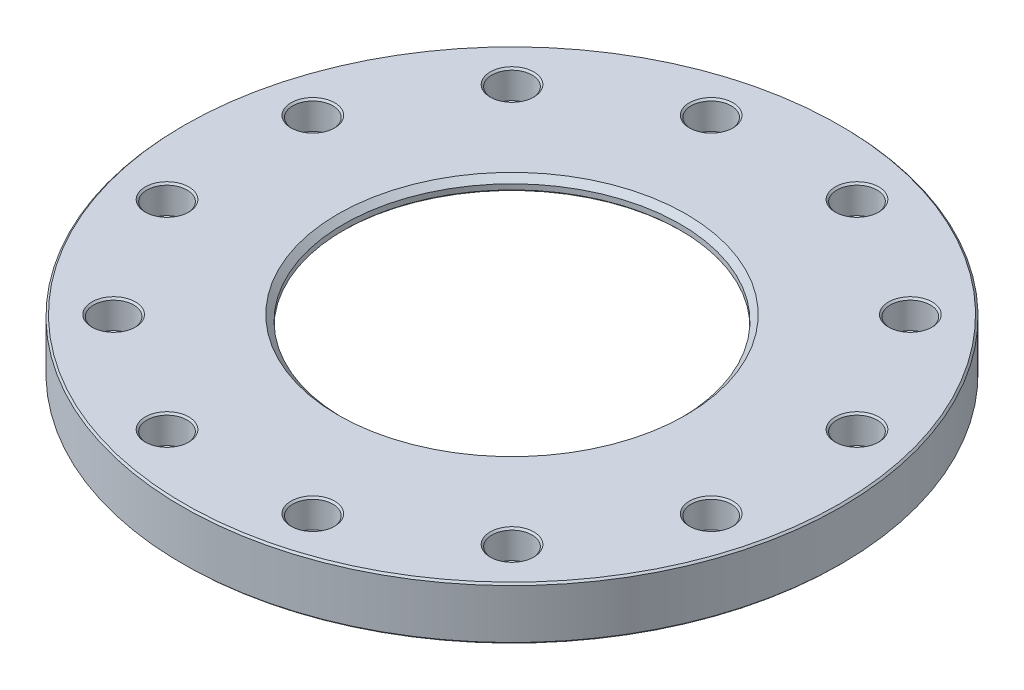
ISO-10303-21;
HEADER;
FILE_DESCRIPTION(('STEP AP214'),'2;1');
FILE_NAME('part.step','',(''),(''),'','','');
FILE_SCHEMA(('AUTOMOTIVE_DESIGN { 1 0 10303 214 1 1 1 1 }'));
ENDSEC;
DATA;
#1=APPLICATION_CONTEXT('core data for automotive mechanical design processes');
#2=APPLICATION_PROTOCOL_DEFINITION('international standard','automotive_design',2000,#1);
#3=PRODUCT_CONTEXT('',#1,'mechanical');
#4=PRODUCT('Part','Part','',(#3));
#5=PRODUCT_RELATED_PRODUCT_CATEGORY('part','',(#4));
#6=PRODUCT_DEFINITION_FORMATION('','',#4);
#7=PRODUCT_DEFINITION_CONTEXT('part definition',#1,'design');
#8=PRODUCT_DEFINITION('design','',#6,#7);
#9=PRODUCT_DEFINITION_SHAPE('','',#8);
#10=(LENGTH_UNIT() NAMED_UNIT(*) SI_UNIT(.MILLI.,.METRE.));
#11=(NAMED_UNIT(*) PLANE_ANGLE_UNIT() SI_UNIT($,.RADIAN.));
#12=(NAMED_UNIT(*) SI_UNIT($,.STERADIAN.) SOLID_ANGLE_UNIT());
#13=UNCERTAINTY_MEASURE_WITH_UNIT(LENGTH_MEASURE(1.E-05),#10,'distance_accuracy_value','');
#14=(GEOMETRIC_REPRESENTATION_CONTEXT(3) GLOBAL_UNCERTAINTY_ASSIGNED_CONTEXT((#13)) GLOBAL_UNIT_ASSIGNED_CONTEXT((#10,
#11,#12)) REPRESENTATION_CONTEXT('',''));
#15=CARTESIAN_POINT('',(0.,0.,0.));
#16=DIRECTION('',(0.,0.,1.));
#17=DIRECTION('',(1.,0.,0.));
#18=AXIS2_PLACEMENT_3D('',#15,#16,#17);
#19=CARTESIAN_POINT('',(0.,5.,0.));
#20=DIRECTION('',(0.,-1.,0.));
#21=DIRECTION('',(1.,0.,0.));
#22=AXIS2_PLACEMENT_3D('',#19,#20,#21);
#23=CYLINDRICAL_SURFACE('',#22,46.8);
#24=CARTESIAN_POINT('',(0.,4.75,0.));
#25=DIRECTION('',(0.,1.,0.));
#26=DIRECTION('',(1.,0.,0.));
#27=AXIS2_PLACEMENT_3D('',#24,#25,#26);
#28=CIRCLE('',#27,46.8);
#29=CARTESIAN_POINT('',(-46.8,4.75,0.));
#30=VERTEX_POINT('',#29);
#31=EDGE_CURVE('E706',#30,#30,#28,.T.);
#32=ORIENTED_EDGE('',*,*,#31,.F.);
#33=DIRECTION('',(0.,-1.,0.));
#34=VECTOR('',#33,1.);
#35=CARTESIAN_POINT('',(-46.8,5.,0.));
#36=LINE('',#35,#34);
#37=CARTESIAN_POINT('',(-46.8,-2.24976997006,0.));
#38=VERTEX_POINT('',#37);
#39=EDGE_CURVE('E10',#30,#38,#36,.T.);
#40=ORIENTED_EDGE('',*,*,#39,.T.);
#41=CARTESIAN_POINT('',(0.,-2.24976997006,0.));
#42=DIRECTION('',(0.,-1.,0.));
#43=DIRECTION('',(1.,0.,0.));
#44=AXIS2_PLACEMENT_3D('',#41,#42,#43);
#45=CIRCLE('',#44,46.8);
#46=EDGE_CURVE('E542',#38,#38,#45,.T.);
#47=ORIENTED_EDGE('',*,*,#46,.F.);
#48=ORIENTED_EDGE('',*,*,#39,.F.);
#49=EDGE_LOOP('',(#32,#40,#47,#48));
#50=FACE_BOUND('',#49,.T.);
#51=ADVANCED_FACE('F16',(#50),#23,.T.);
#52=CARTESIAN_POINT('',(28.284271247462,-2.37476997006,28.284271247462));
#53=DIRECTION('',(0.,-1.,0.));
#54=DIRECTION('',(-1.,0.,0.));
#55=AXIS2_PLACEMENT_3D('',#52,#53,#54);
#56=CONICAL_SURFACE('',#55,1.775,0.785398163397);
#57=CARTESIAN_POINT('',(28.284271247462,-2.49976997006,28.284271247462));
#58=DIRECTION('',(0.,-1.,0.));
#59=DIRECTION('',(-1.,0.,0.));
#60=AXIS2_PLACEMENT_3D('',#57,#58,#59);
#61=CIRCLE('',#60,1.9);
#62=CARTESIAN_POINT('',(30.184271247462,-2.49976997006,28.284271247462));
#63=VERTEX_POINT('',#62);
#64=EDGE_CURVE('E342',#63,#63,#61,.T.);
#65=ORIENTED_EDGE('',*,*,#64,.T.);
#66=DIRECTION('',(-0.707106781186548,0.707106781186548,0.));
#67=VECTOR('',#66,1.);
#68=CARTESIAN_POINT('',(30.059271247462,-2.37476997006,28.284271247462));
#69=LINE('',#68,#67);
#70=CARTESIAN_POINT('',(29.934271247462,-2.24976997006,28.284271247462));
#71=VERTEX_POINT('',#70);
#72=EDGE_CURVE('E26',#63,#71,#69,.T.);
#73=ORIENTED_EDGE('',*,*,#72,.T.);
#74=CARTESIAN_POINT('',(28.284271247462,-2.24976997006,28.284271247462));
#75=DIRECTION('',(0.,1.,0.));
#76=DIRECTION('',(-1.,0.,0.));
#77=AXIS2_PLACEMENT_3D('',#74,#75,#76);
#78=CIRCLE('',#77,1.65);
#79=EDGE_CURVE('E707',#71,#71,#78,.T.);
#80=ORIENTED_EDGE('',*,*,#79,.T.);
#81=ORIENTED_EDGE('',*,*,#72,.F.);
#82=EDGE_LOOP('',(#65,#73,#80,#81));
#83=FACE_BOUND('',#82,.T.);
#84=ADVANCED_FACE('F983',(#83),#56,.F.);
#85=CARTESIAN_POINT('',(-10.3527618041,-2.37476997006,38.637033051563));
#86=DIRECTION('',(0.,-1.,0.));
#87=DIRECTION('',(-1.,0.,0.));
#88=AXIS2_PLACEMENT_3D('',#85,#86,#87);
#89=CONICAL_SURFACE('',#88,1.775,0.785398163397);
#90=CARTESIAN_POINT('',(-10.3527618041,-2.49976997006,38.637033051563));
#91=DIRECTION('',(0.,-1.,0.));
#92=DIRECTION('',(-1.,0.,0.));
#93=AXIS2_PLACEMENT_3D('',#90,#91,#92);
#94=CIRCLE('',#93,1.9);
#95=CARTESIAN_POINT('',(-8.452761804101,-2.49976997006,38.637033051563));
#96=VERTEX_POINT('',#95);
#97=EDGE_CURVE('E460',#96,#96,#94,.T.);
#98=ORIENTED_EDGE('',*,*,#97,.T.);
#99=DIRECTION('',(-0.707106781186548,0.707106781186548,0.));
#100=VECTOR('',#99,1.);
#101=CARTESIAN_POINT('',(-8.577761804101,-2.37476997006,38.637033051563));
#102=LINE('',#101,#100);
#103=CARTESIAN_POINT('',(-8.702761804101,-2.24976997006,38.637033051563));
#104=VERTEX_POINT('',#103);
#105=EDGE_CURVE('E508',#96,#104,#102,.T.);
#106=ORIENTED_EDGE('',*,*,#105,.T.);
#107=CARTESIAN_POINT('',(-10.3527618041,-2.24976997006,38.637033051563));
#108=DIRECTION('',(0.,1.,0.));
#109=DIRECTION('',(-1.,0.,0.));
#110=AXIS2_PLACEMENT_3D('',#107,#108,#109);
#111=CIRCLE('',#110,1.65);
#112=EDGE_CURVE('E540',#104,#104,#111,.T.);
#113=ORIENTED_EDGE('',*,*,#112,.T.);
#114=ORIENTED_EDGE('',*,*,#105,.F.);
#115=EDGE_LOOP('',(#98,#106,#113,#114));
#116=FACE_BOUND('',#115,.T.);
#117=ADVANCED_FACE('F987',(#116),#89,.F.);
#118=CARTESIAN_POINT('',(-38.63703305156,-2.37476997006,10.352761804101));
#119=DIRECTION('',(0.,-1.,0.));
#120=DIRECTION('',(-1.,0.,0.));
#121=AXIS2_PLACEMENT_3D('',#118,#119,#120);
#122=CONICAL_SURFACE('',#121,1.775,0.785398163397);
#123=CARTESIAN_POINT('',(-38.63703305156,-2.49976997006,10.352761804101));
#124=DIRECTION('',(0.,-1.,0.));
#125=DIRECTION('',(-1.,0.,0.));
#126=AXIS2_PLACEMENT_3D('',#123,#124,#125);
#127=CIRCLE('',#126,1.9);
#128=CARTESIAN_POINT('',(-36.73703305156,-2.49976997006,10.352761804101));
#129=VERTEX_POINT('',#128);
#130=EDGE_CURVE('E609',#129,#129,#127,.T.);
#131=ORIENTED_EDGE('',*,*,#130,.T.);
#132=DIRECTION('',(-0.707106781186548,0.707106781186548,0.));
#133=VECTOR('',#132,1.);
#134=CARTESIAN_POINT('',(-36.86203305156,-2.37476997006,10.352761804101));
#135=LINE('',#134,#133);
#136=CARTESIAN_POINT('',(-36.98703305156,-2.24976997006,10.352761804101));
#137=VERTEX_POINT('',#136);
#138=EDGE_CURVE('E505',#129,#137,#135,.T.);
#139=ORIENTED_EDGE('',*,*,#138,.T.);
#140=CARTESIAN_POINT('',(-38.63703305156,-2.24976997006,10.352761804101));
#141=DIRECTION('',(0.,1.,0.));
#142=DIRECTION('',(-1.,0.,0.));
#143=AXIS2_PLACEMENT_3D('',#140,#141,#142);
#144=CIRCLE('',#143,1.65);
#145=EDGE_CURVE('E313',#137,#137,#144,.T.);
#146=ORIENTED_EDGE('',*,*,#145,.T.);
#147=ORIENTED_EDGE('',*,*,#138,.F.);
#148=EDGE_LOOP('',(#131,#139,#146,#147));
#149=FACE_BOUND('',#148,.T.);
#150=ADVANCED_FACE('F991',(#149),#122,.F.);
#151=CARTESIAN_POINT('',(-28.28427124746,-2.37476997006,-28.28427124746));
#152=DIRECTION('',(0.,-1.,0.));
#153=DIRECTION('',(-1.,0.,0.));
#154=AXIS2_PLACEMENT_3D('',#151,#152,#153);
#155=CONICAL_SURFACE('',#154,1.775,0.785398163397);
#156=CARTESIAN_POINT('',(-28.28427124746,-2.49976997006,-28.28427124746));
#157=DIRECTION('',(0.,-1.,0.));
#158=DIRECTION('',(-1.,0.,0.));
#159=AXIS2_PLACEMENT_3D('',#156,#157,#158);
#160=CIRCLE('',#159,1.9);
#161=CARTESIAN_POINT('',(-26.38427124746,-2.49976997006,-28.28427124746));
#162=VERTEX_POINT('',#161);
#163=EDGE_CURVE('E613',#162,#162,#160,.T.);
#164=ORIENTED_EDGE('',*,*,#163,.T.);
#165=DIRECTION('',(-0.707106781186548,0.707106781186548,0.));
#166=VECTOR('',#165,1.);
#167=CARTESIAN_POINT('',(-26.50927124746,-2.37476997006,-28.28427124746));
#168=LINE('',#167,#166);
#169=CARTESIAN_POINT('',(-26.63427124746,-2.24976997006,-28.28427124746));
#170=VERTEX_POINT('',#169);
#171=EDGE_CURVE('E509',#162,#170,#168,.T.);
#172=ORIENTED_EDGE('',*,*,#171,.T.);
#173=CARTESIAN_POINT('',(-28.28427124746,-2.24976997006,-28.28427124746));
#174=DIRECTION('',(0.,1.,0.));
#175=DIRECTION('',(-1.,0.,0.));
#176=AXIS2_PLACEMENT_3D('',#173,#174,#175);
#177=CIRCLE('',#176,1.65);
#178=EDGE_CURVE('E422',#170,#170,#177,.T.);
#179=ORIENTED_EDGE('',*,*,#178,.T.);
#180=ORIENTED_EDGE('',*,*,#171,.F.);
#181=EDGE_LOOP('',(#164,#172,#179,#180));
#182=FACE_BOUND('',#181,.T.);
#183=ADVANCED_FACE('F1072',(#182),#155,.F.);
#184=CARTESIAN_POINT('',(10.352761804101,-2.37476997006,-38.63703305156));
#185=DIRECTION('',(0.,-1.,0.));
#186=DIRECTION('',(-1.,0.,0.));
#187=AXIS2_PLACEMENT_3D('',#184,#185,#186);
#188=CONICAL_SURFACE('',#187,1.775,0.785398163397);
#189=CARTESIAN_POINT('',(10.352761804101,-2.49976997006,-38.63703305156));
#190=DIRECTION('',(0.,-1.,0.));
#191=DIRECTION('',(-1.,0.,0.));
#192=AXIS2_PLACEMENT_3D('',#189,#190,#191);
#193=CIRCLE('',#192,1.9);
#194=CARTESIAN_POINT('',(12.252761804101,-2.49976997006,-38.63703305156));
#195=VERTEX_POINT('',#194);
#196=EDGE_CURVE('E680',#195,#195,#193,.T.);
#197=ORIENTED_EDGE('',*,*,#196,.T.);
#198=DIRECTION('',(-0.707106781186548,0.707106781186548,0.));
#199=VECTOR('',#198,1.);
#200=CARTESIAN_POINT('',(12.127761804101,-2.37476997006,-38.63703305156));
#201=LINE('',#200,#199);
#202=CARTESIAN_POINT('',(12.002761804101,-2.24976997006,-38.63703305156));
#203=VERTEX_POINT('',#202);
#204=EDGE_CURVE('E732',#195,#203,#201,.T.);
#205=ORIENTED_EDGE('',*,*,#204,.T.);
#206=CARTESIAN_POINT('',(10.352761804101,-2.24976997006,-38.63703305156));
#207=DIRECTION('',(0.,1.,0.));
#208=DIRECTION('',(-1.,0.,0.));
#209=AXIS2_PLACEMENT_3D('',#206,#207,#208);
#210=CIRCLE('',#209,1.65);
#211=EDGE_CURVE('E356',#203,#203,#210,.T.);
#212=ORIENTED_EDGE('',*,*,#211,.T.);
#213=ORIENTED_EDGE('',*,*,#204,.F.);
#214=EDGE_LOOP('',(#197,#205,#212,#213));
#215=FACE_BOUND('',#214,.T.);
#216=ADVANCED_FACE('F1068',(#215),#188,.F.);
#217=CARTESIAN_POINT('',(38.637033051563,-2.37476997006,-10.3527618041));
#218=DIRECTION('',(0.,-1.,0.));
#219=DIRECTION('',(-1.,0.,0.));
#220=AXIS2_PLACEMENT_3D('',#217,#218,#219);
#221=CONICAL_SURFACE('',#220,1.775,0.785398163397);
#222=CARTESIAN_POINT('',(38.637033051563,-2.49976997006,-10.3527618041));
#223=DIRECTION('',(0.,-1.,0.));
#224=DIRECTION('',(-1.,0.,0.));
#225=AXIS2_PLACEMENT_3D('',#222,#223,#224);
#226=CIRCLE('',#225,1.9);
#227=CARTESIAN_POINT('',(40.537033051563,-2.49976997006,-10.3527618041));
#228=VERTEX_POINT('',#227);
#229=EDGE_CURVE('E349',#228,#228,#226,.T.);
#230=ORIENTED_EDGE('',*,*,#229,.T.);
#231=DIRECTION('',(-0.707106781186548,0.707106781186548,0.));
#232=VECTOR('',#231,1.);
#233=CARTESIAN_POINT('',(40.412033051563,-2.37476997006,-10.3527618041));
#234=LINE('',#233,#232);
#235=CARTESIAN_POINT('',(40.287033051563,-2.24976997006,-10.3527618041));
#236=VERTEX_POINT('',#235);
#237=EDGE_CURVE('E729',#228,#236,#234,.T.);
#238=ORIENTED_EDGE('',*,*,#237,.T.);
#239=CARTESIAN_POINT('',(38.637033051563,-2.24976997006,-10.3527618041));
#240=DIRECTION('',(0.,1.,0.));
#241=DIRECTION('',(-1.,0.,0.));
#242=AXIS2_PLACEMENT_3D('',#239,#240,#241);
#243=CIRCLE('',#242,1.65);
#244=EDGE_CURVE('E736',#236,#236,#243,.T.);
#245=ORIENTED_EDGE('',*,*,#244,.T.);
#246=ORIENTED_EDGE('',*,*,#237,.F.);
#247=EDGE_LOOP('',(#230,#238,#245,#246));
#248=FACE_BOUND('',#247,.T.);
#249=ADVANCED_FACE('F1071',(#248),#221,.F.);
#250=CARTESIAN_POINT('',(0.,-2.37476997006,0.));
#251=DIRECTION('',(0.,-1.,0.));
#252=DIRECTION('',(1.,0.,0.));
#253=AXIS2_PLACEMENT_3D('',#250,#251,#252);
#254=CONICAL_SURFACE('',#253,35.375,0.785398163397);
#255=CARTESIAN_POINT('',(0.,-2.49976997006,0.));
#256=DIRECTION('',(0.,-1.,0.));
#257=DIRECTION('',(1.,0.,0.));
#258=AXIS2_PLACEMENT_3D('',#255,#256,#257);
#259=CIRCLE('',#258,35.5);
#260=CARTESIAN_POINT('',(-35.5,-2.49976997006,0.));
#261=VERTEX_POINT('',#260);
#262=EDGE_CURVE('E344',#261,#261,#259,.T.);
#263=ORIENTED_EDGE('',*,*,#262,.T.);
#264=DIRECTION('',(0.707106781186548,0.707106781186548,0.));
#265=VECTOR('',#264,1.);
#266=CARTESIAN_POINT('',(-35.375,-2.37476997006,0.));
#267=LINE('',#266,#265);
#268=CARTESIAN_POINT('',(-35.25,-2.24976997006,0.));
#269=VERTEX_POINT('',#268);
#270=EDGE_CURVE('E733',#261,#269,#267,.T.);
#271=ORIENTED_EDGE('',*,*,#270,.T.);
#272=CARTESIAN_POINT('',(0.,-2.24976997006,0.));
#273=DIRECTION('',(0.,1.,0.));
#274=DIRECTION('',(1.,0.,0.));
#275=AXIS2_PLACEMENT_3D('',#272,#273,#274);
#276=CIRCLE('',#275,35.25);
#277=EDGE_CURVE('E531',#269,#269,#276,.T.);
#278=ORIENTED_EDGE('',*,*,#277,.T.);
#279=ORIENTED_EDGE('',*,*,#270,.F.);
#280=EDGE_LOOP('',(#263,#271,#278,#279));
#281=FACE_BOUND('',#280,.T.);
#282=ADVANCED_FACE('F1413',(#281),#254,.F.);
#283=CARTESIAN_POINT('',(38.637033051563,-2.37476997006,10.352761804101));
#284=DIRECTION('',(0.,-1.,0.));
#285=DIRECTION('',(-1.,0.,0.));
#286=AXIS2_PLACEMENT_3D('',#283,#284,#285);
#287=CONICAL_SURFACE('',#286,1.775,0.785398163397);
#288=CARTESIAN_POINT('',(38.637033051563,-2.49976997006,10.352761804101));
#289=DIRECTION('',(0.,-1.,0.));
#290=DIRECTION('',(-1.,0.,0.));
#291=AXIS2_PLACEMENT_3D('',#288,#289,#290);
#292=CIRCLE('',#291,1.9);
#293=CARTESIAN_POINT('',(40.537033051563,-2.49976997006,10.352761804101));
#294=VERTEX_POINT('',#293);
#295=EDGE_CURVE('E348',#294,#294,#292,.T.);
#296=ORIENTED_EDGE('',*,*,#295,.T.);
#297=DIRECTION('',(-0.707106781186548,0.707106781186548,0.));
#298=VECTOR('',#297,1.);
#299=CARTESIAN_POINT('',(40.412033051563,-2.37476997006,10.352761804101));
#300=LINE('',#299,#298);
#301=CARTESIAN_POINT('',(40.287033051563,-2.24976997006,10.352761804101));
#302=VERTEX_POINT('',#301);
#303=EDGE_CURVE('E676',#294,#302,#300,.T.);
#304=ORIENTED_EDGE('',*,*,#303,.T.);
#305=CARTESIAN_POINT('',(38.637033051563,-2.24976997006,10.352761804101));
#306=DIRECTION('',(0.,1.,0.));
#307=DIRECTION('',(-1.,0.,0.));
#308=AXIS2_PLACEMENT_3D('',#305,#306,#307);
#309=CIRCLE('',#308,1.65);
#310=EDGE_CURVE('E635',#302,#302,#309,.T.);
#311=ORIENTED_EDGE('',*,*,#310,.T.);
#312=ORIENTED_EDGE('',*,*,#303,.F.);
#313=EDGE_LOOP('',(#296,#304,#311,#312));
#314=FACE_BOUND('',#313,.T.);
#315=ADVANCED_FACE('F1114',(#314),#287,.F.);
#316=CARTESIAN_POINT('',(28.284271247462,-2.37476997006,-28.28427124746));
#317=DIRECTION('',(0.,-1.,0.));
#318=DIRECTION('',(-1.,0.,0.));
#319=AXIS2_PLACEMENT_3D('',#316,#317,#318);
#320=CONICAL_SURFACE('',#319,1.775,0.785398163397);
#321=CARTESIAN_POINT('',(28.284271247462,-2.49976997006,-28.28427124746));
#322=DIRECTION('',(0.,-1.,0.));
#323=DIRECTION('',(-1.,0.,0.));
#324=AXIS2_PLACEMENT_3D('',#321,#322,#323);
#325=CIRCLE('',#324,1.9);
#326=CARTESIAN_POINT('',(30.184271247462,-2.49976997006,-28.28427124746));
#327=VERTEX_POINT('',#326);
#328=EDGE_CURVE('E447',#327,#327,#325,.T.);
#329=ORIENTED_EDGE('',*,*,#328,.T.);
#330=DIRECTION('',(-0.707106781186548,0.707106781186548,0.));
#331=VECTOR('',#330,1.);
#332=CARTESIAN_POINT('',(30.059271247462,-2.37476997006,-28.28427124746));
#333=LINE('',#332,#331);
#334=CARTESIAN_POINT('',(29.934271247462,-2.24976997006,-28.28427124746));
#335=VERTEX_POINT('',#334);
#336=EDGE_CURVE('E501',#327,#335,#333,.T.);
#337=ORIENTED_EDGE('',*,*,#336,.T.);
#338=CARTESIAN_POINT('',(28.284271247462,-2.24976997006,-28.28427124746));
#339=DIRECTION('',(0.,1.,0.));
#340=DIRECTION('',(-1.,0.,0.));
#341=AXIS2_PLACEMENT_3D('',#338,#339,#340);
#342=CIRCLE('',#341,1.65);
#343=EDGE_CURVE('E321',#335,#335,#342,.T.);
#344=ORIENTED_EDGE('',*,*,#343,.T.);
#345=ORIENTED_EDGE('',*,*,#336,.F.);
#346=EDGE_LOOP('',(#329,#337,#344,#345));
#347=FACE_BOUND('',#346,.T.);
#348=ADVANCED_FACE('F1097',(#347),#320,.F.);
#349=CARTESIAN_POINT('',(-10.3527618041,-2.37476997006,-38.63703305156));
#350=DIRECTION('',(0.,-1.,0.));
#351=DIRECTION('',(-1.,0.,0.));
#352=AXIS2_PLACEMENT_3D('',#349,#350,#351);
#353=CONICAL_SURFACE('',#352,1.775,0.785398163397);
#354=CARTESIAN_POINT('',(-10.3527618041,-2.49976997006,-38.63703305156));
#355=DIRECTION('',(0.,-1.,0.));
#356=DIRECTION('',(-1.,0.,0.));
#357=AXIS2_PLACEMENT_3D('',#354,#355,#356);
#358=CIRCLE('',#357,1.9);
#359=CARTESIAN_POINT('',(-8.452761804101,-2.49976997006,-38.63703305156));
#360=VERTEX_POINT('',#359);
#361=EDGE_CURVE('E442',#360,#360,#358,.T.);
#362=ORIENTED_EDGE('',*,*,#361,.T.);
#363=DIRECTION('',(-0.707106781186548,0.707106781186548,0.));
#364=VECTOR('',#363,1.);
#365=CARTESIAN_POINT('',(-8.577761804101,-2.37476997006,-38.63703305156));
#366=LINE('',#365,#364);
#367=CARTESIAN_POINT('',(-8.702761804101,-2.24976997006,-38.63703305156));
#368=VERTEX_POINT('',#367);
#369=EDGE_CURVE('E497',#360,#368,#366,.T.);
#370=ORIENTED_EDGE('',*,*,#369,.T.);
#371=CARTESIAN_POINT('',(-10.3527618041,-2.24976997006,-38.63703305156));
#372=DIRECTION('',(0.,1.,0.));
#373=DIRECTION('',(-1.,0.,0.));
#374=AXIS2_PLACEMENT_3D('',#371,#372,#373);
#375=CIRCLE('',#374,1.65);
#376=EDGE_CURVE('E479',#368,#368,#375,.T.);
#377=ORIENTED_EDGE('',*,*,#376,.T.);
#378=ORIENTED_EDGE('',*,*,#369,.F.);
#379=EDGE_LOOP('',(#362,#370,#377,#378));
#380=FACE_BOUND('',#379,.T.);
#381=ADVANCED_FACE('F1094',(#380),#353,.F.);
#382=CARTESIAN_POINT('',(-38.63703305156,-2.37476997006,-10.3527618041));
#383=DIRECTION('',(0.,-1.,0.));
#384=DIRECTION('',(-1.,0.,0.));
#385=AXIS2_PLACEMENT_3D('',#382,#383,#384);
#386=CONICAL_SURFACE('',#385,1.775,0.785398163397);
#387=CARTESIAN_POINT('',(-38.63703305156,-2.49976997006,-10.3527618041));
#388=DIRECTION('',(0.,-1.,0.));
#389=DIRECTION('',(-1.,0.,0.));
#390=AXIS2_PLACEMENT_3D('',#387,#388,#389);
#391=CIRCLE('',#390,1.9);
#392=CARTESIAN_POINT('',(-36.73703305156,-2.49976997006,-10.3527618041));
#393=VERTEX_POINT('',#392);
#394=EDGE_CURVE('E446',#393,#393,#391,.T.);
#395=ORIENTED_EDGE('',*,*,#394,.T.);
#396=DIRECTION('',(-0.707106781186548,0.707106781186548,0.));
#397=VECTOR('',#396,1.);
#398=CARTESIAN_POINT('',(-36.86203305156,-2.37476997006,-10.3527618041));
#399=LINE('',#398,#397);
#400=CARTESIAN_POINT('',(-36.98703305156,-2.24976997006,-10.3527618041));
#401=VERTEX_POINT('',#400);
#402=EDGE_CURVE('E372',#393,#401,#399,.T.);
#403=ORIENTED_EDGE('',*,*,#402,.T.);
#404=CARTESIAN_POINT('',(-38.63703305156,-2.24976997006,-10.3527618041));
#405=DIRECTION('',(0.,1.,0.));
#406=DIRECTION('',(-1.,0.,0.));
#407=AXIS2_PLACEMENT_3D('',#404,#405,#406);
#408=CIRCLE('',#407,1.65);
#409=EDGE_CURVE('E591',#401,#401,#408,.T.);
#410=ORIENTED_EDGE('',*,*,#409,.T.);
#411=ORIENTED_EDGE('',*,*,#402,.F.);
#412=EDGE_LOOP('',(#395,#403,#410,#411));
#413=FACE_BOUND('',#412,.T.);
#414=ADVANCED_FACE('F1063',(#413),#386,.F.);
#415=CARTESIAN_POINT('',(-28.28427124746,-2.37476997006,28.284271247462));
#416=DIRECTION('',(0.,-1.,0.));
#417=DIRECTION('',(-1.,0.,0.));
#418=AXIS2_PLACEMENT_3D('',#415,#416,#417);
#419=CONICAL_SURFACE('',#418,1.775,0.785398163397);
#420=CARTESIAN_POINT('',(-28.28427124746,-2.49976997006,28.284271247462));
#421=DIRECTION('',(0.,-1.,0.));
#422=DIRECTION('',(-1.,0.,0.));
#423=AXIS2_PLACEMENT_3D('',#420,#421,#422);
#424=CIRCLE('',#423,1.9);
#425=CARTESIAN_POINT('',(-26.38427124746,-2.49976997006,28.284271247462));
#426=VERTEX_POINT('',#425);
#427=EDGE_CURVE('E626',#426,#426,#424,.T.);
#428=ORIENTED_EDGE('',*,*,#427,.T.);
#429=DIRECTION('',(-0.707106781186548,0.707106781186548,0.));
#430=VECTOR('',#429,1.);
#431=CARTESIAN_POINT('',(-26.50927124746,-2.37476997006,28.284271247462));
#432=LINE('',#431,#430);
#433=CARTESIAN_POINT('',(-26.63427124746,-2.24976997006,28.284271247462));
#434=VERTEX_POINT('',#433);
#435=EDGE_CURVE('E368',#426,#434,#432,.T.);
#436=ORIENTED_EDGE('',*,*,#435,.T.);
#437=CARTESIAN_POINT('',(-28.28427124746,-2.24976997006,28.284271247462));
#438=DIRECTION('',(0.,1.,0.));
#439=DIRECTION('',(-1.,0.,0.));
#440=AXIS2_PLACEMENT_3D('',#437,#438,#439);
#441=CIRCLE('',#440,1.65);
#442=EDGE_CURVE('E625',#434,#434,#441,.T.);
#443=ORIENTED_EDGE('',*,*,#442,.T.);
#444=ORIENTED_EDGE('',*,*,#435,.F.);
#445=EDGE_LOOP('',(#428,#436,#443,#444));
#446=FACE_BOUND('',#445,.T.);
#447=ADVANCED_FACE('F898',(#446),#419,.F.);
#448=CARTESIAN_POINT('',(0.,4.875,0.));
#449=DIRECTION('',(0.,-1.,0.));
#450=DIRECTION('',(1.,0.,0.));
#451=AXIS2_PLACEMENT_3D('',#448,#449,#450);
#452=CONICAL_SURFACE('',#451,46.675,0.785398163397);
#453=ORIENTED_EDGE('',*,*,#31,.T.);
#454=DIRECTION('',(0.707106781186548,0.707106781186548,0.));
#455=VECTOR('',#454,1.);
#456=CARTESIAN_POINT('',(-46.675,4.875,0.));
#457=LINE('',#456,#455);
#458=CARTESIAN_POINT('',(-46.55,5.,0.));
#459=VERTEX_POINT('',#458);
#460=EDGE_CURVE('E373',#30,#459,#457,.T.);
#461=ORIENTED_EDGE('',*,*,#460,.T.);
#462=CARTESIAN_POINT('',(0.,5.,0.));
#463=DIRECTION('',(0.,-1.,0.));
#464=DIRECTION('',(1.,0.,0.));
#465=AXIS2_PLACEMENT_3D('',#462,#463,#464);
#466=CIRCLE('',#465,46.55);
#467=EDGE_CURVE('E400',#459,#459,#466,.T.);
#468=ORIENTED_EDGE('',*,*,#467,.T.);
#469=ORIENTED_EDGE('',*,*,#460,.F.);
#470=EDGE_LOOP('',(#453,#461,#468,#469));
#471=FACE_BOUND('',#470,.T.);
#472=ADVANCED_FACE('F958',(#471),#452,.T.);
#473=CARTESIAN_POINT('',(-28.28427124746,5.,-28.28427124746));
#474=DIRECTION('',(0.,-1.,0.));
#475=DIRECTION('',(-1.,0.,0.));
#476=AXIS2_PLACEMENT_3D('',#473,#474,#475);
#477=CYLINDRICAL_SURFACE('',#476,1.65);
#478=CARTESIAN_POINT('',(-28.28427124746,0.75,-28.28427124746));
#479=DIRECTION('',(0.,-1.,0.));
#480=DIRECTION('',(-1.,0.,0.));
#481=AXIS2_PLACEMENT_3D('',#478,#479,#480);
#482=CIRCLE('',#481,1.65);
#483=CARTESIAN_POINT('',(-26.63427124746,0.75,-28.28427124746));
#484=VERTEX_POINT('',#483);
#485=EDGE_CURVE('E604',#484,#484,#482,.T.);
#486=ORIENTED_EDGE('',*,*,#485,.F.);
#487=DIRECTION('',(0.,-1.,0.));
#488=VECTOR('',#487,1.);
#489=CARTESIAN_POINT('',(-26.63427124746,5.,-28.28427124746));
#490=LINE('',#489,#488);
#491=EDGE_CURVE('E418',#484,#170,#490,.T.);
#492=ORIENTED_EDGE('',*,*,#491,.T.);
#493=ORIENTED_EDGE('',*,*,#178,.F.);
#494=ORIENTED_EDGE('',*,*,#491,.F.);
#495=EDGE_LOOP('',(#486,#492,#493,#494));
#496=FACE_BOUND('',#495,.T.);
#497=ADVANCED_FACE('F1059',(#496),#477,.F.);
#498=CARTESIAN_POINT('',(-28.28427124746,0.875,-28.28427124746));
#499=DIRECTION('',(0.,1.,0.));
#500=DIRECTION('',(-1.,0.,0.));
#501=AXIS2_PLACEMENT_3D('',#498,#499,#500);
#502=CONICAL_SURFACE('',#501,1.775,0.785398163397);
#503=ORIENTED_EDGE('',*,*,#485,.T.);
#504=DIRECTION('',(0.707106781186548,0.707106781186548,0.));
#505=VECTOR('',#504,1.);
#506=CARTESIAN_POINT('',(-26.50927124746,0.875,-28.28427124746));
#507=LINE('',#506,#505);
#508=CARTESIAN_POINT('',(-26.38427124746,1.,-28.28427124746));
#509=VERTEX_POINT('',#508);
#510=EDGE_CURVE('E423',#484,#509,#507,.T.);
#511=ORIENTED_EDGE('',*,*,#510,.T.);
#512=CARTESIAN_POINT('',(-28.28427124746,1.,-28.28427124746));
#513=DIRECTION('',(0.,1.,0.));
#514=DIRECTION('',(-1.,0.,0.));
#515=AXIS2_PLACEMENT_3D('',#512,#513,#514);
#516=CIRCLE('',#515,1.9);
#517=EDGE_CURVE('E608',#509,#509,#516,.T.);
#518=ORIENTED_EDGE('',*,*,#517,.T.);
#519=ORIENTED_EDGE('',*,*,#510,.F.);
#520=EDGE_LOOP('',(#503,#511,#518,#519));
#521=FACE_BOUND('',#520,.T.);
#522=ADVANCED_FACE('F1005',(#521),#502,.F.);
#523=CARTESIAN_POINT('',(-28.28427124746,1.,-28.28427124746));
#524=DIRECTION('',(0.,1.,0.));
#525=DIRECTION('',(0.,0.,-1.));
#526=AXIS2_PLACEMENT_3D('',#523,#524,#525);
#527=PLANE('',#526);
#528=ORIENTED_EDGE('',*,*,#517,.F.);
#529=EDGE_LOOP('',(#528));
#530=FACE_BOUND('',#529,.T.);
#531=CARTESIAN_POINT('',(-28.28427124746,1.,-28.28427124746));
#532=DIRECTION('',(0.,-1.,0.));
#533=DIRECTION('',(-1.,0.,0.));
#534=AXIS2_PLACEMENT_3D('',#531,#532,#533);
#535=CIRCLE('',#534,2.85);
#536=CARTESIAN_POINT('',(-25.43427124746,1.,-28.28427124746));
#537=VERTEX_POINT('',#536);
#538=EDGE_CURVE('E748',#537,#537,#535,.T.);
#539=ORIENTED_EDGE('',*,*,#538,.F.);
#540=EDGE_LOOP('',(#539));
#541=FACE_BOUND('',#540,.T.);
#542=ADVANCED_FACE('F1001',(#530,#541),#527,.T.);
#543=CARTESIAN_POINT('',(-28.28427124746,5.,-28.28427124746));
#544=DIRECTION('',(0.,-1.,0.));
#545=DIRECTION('',(-1.,0.,0.));
#546=AXIS2_PLACEMENT_3D('',#543,#544,#545);
#547=CYLINDRICAL_SURFACE('',#546,2.85);
#548=CARTESIAN_POINT('',(-28.28427124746,4.75,-28.28427124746));
#549=DIRECTION('',(0.,-1.,0.));
#550=DIRECTION('',(-1.,0.,0.));
#551=AXIS2_PLACEMENT_3D('',#548,#549,#550);
#552=CIRCLE('',#551,2.85);
#553=CARTESIAN_POINT('',(-25.43427124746,4.75,-28.28427124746));
#554=VERTEX_POINT('',#553);
#555=EDGE_CURVE('E749',#554,#554,#552,.T.);
#556=ORIENTED_EDGE('',*,*,#555,.F.);
#557=DIRECTION('',(0.,-1.,0.));
#558=VECTOR('',#557,1.);
#559=CARTESIAN_POINT('',(-25.43427124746,5.,-28.28427124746));
#560=LINE('',#559,#558);
#561=EDGE_CURVE('E744',#554,#537,#560,.T.);
#562=ORIENTED_EDGE('',*,*,#561,.T.);
#563=ORIENTED_EDGE('',*,*,#538,.T.);
#564=ORIENTED_EDGE('',*,*,#561,.F.);
#565=EDGE_LOOP('',(#556,#562,#563,#564));
#566=FACE_BOUND('',#565,.T.);
#567=ADVANCED_FACE('F1004',(#566),#547,.F.);
#568=CARTESIAN_POINT('',(-28.28427124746,4.875,-28.28427124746));
#569=DIRECTION('',(0.,1.,0.));
#570=DIRECTION('',(-1.,0.,0.));
#571=AXIS2_PLACEMENT_3D('',#568,#569,#570);
#572=CONICAL_SURFACE('',#571,2.975,0.785398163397);
#573=CARTESIAN_POINT('',(-28.28427124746,5.,-28.28427124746));
#574=DIRECTION('',(0.,1.,0.));
#575=DIRECTION('',(-1.,0.,0.));
#576=AXIS2_PLACEMENT_3D('',#573,#574,#575);
#577=CIRCLE('',#576,3.1);
#578=CARTESIAN_POINT('',(-25.18427124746,5.,-28.28427124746));
#579=VERTEX_POINT('',#578);
#580=EDGE_CURVE('E404',#579,#579,#577,.T.);
#581=ORIENTED_EDGE('',*,*,#580,.T.);
#582=DIRECTION('',(-0.707106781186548,-0.707106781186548,0.));
#583=VECTOR('',#582,1.);
#584=CARTESIAN_POINT('',(-25.30927124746,4.875,-28.28427124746));
#585=LINE('',#584,#583);
#586=EDGE_CURVE('E760',#579,#554,#585,.T.);
#587=ORIENTED_EDGE('',*,*,#586,.T.);
#588=ORIENTED_EDGE('',*,*,#555,.T.);
#589=ORIENTED_EDGE('',*,*,#586,.F.);
#590=EDGE_LOOP('',(#581,#587,#588,#589));
#591=FACE_BOUND('',#590,.T.);
#592=ADVANCED_FACE('F1118',(#591),#572,.F.);
#593=CARTESIAN_POINT('',(-38.63703305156,5.,-10.3527618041));
#594=DIRECTION('',(0.,-1.,0.));
#595=DIRECTION('',(-1.,0.,0.));
#596=AXIS2_PLACEMENT_3D('',#593,#594,#595);
#597=CYLINDRICAL_SURFACE('',#596,1.65);
#598=CARTESIAN_POINT('',(-38.63703305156,0.75,-10.3527618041));
#599=DIRECTION('',(0.,-1.,0.));
#600=DIRECTION('',(-1.,0.,0.));
#601=AXIS2_PLACEMENT_3D('',#598,#599,#600);
#602=CIRCLE('',#601,1.65);
#603=CARTESIAN_POINT('',(-36.98703305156,0.75,-10.3527618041));
#604=VERTEX_POINT('',#603);
#605=EDGE_CURVE('E655',#604,#604,#602,.T.);
#606=ORIENTED_EDGE('',*,*,#605,.F.);
#607=DIRECTION('',(0.,-1.,0.));
#608=VECTOR('',#607,1.);
#609=CARTESIAN_POINT('',(-36.98703305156,5.,-10.3527618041));
#610=LINE('',#609,#608);
#611=EDGE_CURVE('E587',#604,#401,#610,.T.);
#612=ORIENTED_EDGE('',*,*,#611,.T.);
#613=ORIENTED_EDGE('',*,*,#409,.F.);
#614=ORIENTED_EDGE('',*,*,#611,.F.);
#615=EDGE_LOOP('',(#606,#612,#613,#614));
#616=FACE_BOUND('',#615,.T.);
#617=ADVANCED_FACE('F1110',(#616),#597,.F.);
#618=CARTESIAN_POINT('',(-38.63703305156,0.875,-10.3527618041));
#619=DIRECTION('',(0.,1.,0.));
#620=DIRECTION('',(-1.,0.,0.));
#621=AXIS2_PLACEMENT_3D('',#618,#619,#620);
#622=CONICAL_SURFACE('',#621,1.775,0.785398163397);
#623=ORIENTED_EDGE('',*,*,#605,.T.);
#624=DIRECTION('',(0.707106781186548,0.707106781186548,0.));
#625=VECTOR('',#624,1.);
#626=CARTESIAN_POINT('',(-36.86203305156,0.875,-10.3527618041));
#627=LINE('',#626,#625);
#628=CARTESIAN_POINT('',(-36.73703305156,1.,-10.3527618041));
#629=VERTEX_POINT('',#628);
#630=EDGE_CURVE('E592',#604,#629,#627,.T.);
#631=ORIENTED_EDGE('',*,*,#630,.T.);
#632=CARTESIAN_POINT('',(-38.63703305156,1.,-10.3527618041));
#633=DIRECTION('',(0.,1.,0.));
#634=DIRECTION('',(-1.,0.,0.));
#635=AXIS2_PLACEMENT_3D('',#632,#633,#634);
#636=CIRCLE('',#635,1.9);
#637=EDGE_CURVE('E659',#629,#629,#636,.T.);
#638=ORIENTED_EDGE('',*,*,#637,.T.);
#639=ORIENTED_EDGE('',*,*,#630,.F.);
#640=EDGE_LOOP('',(#623,#631,#638,#639));
#641=FACE_BOUND('',#640,.T.);
#642=ADVANCED_FACE('F1106',(#641),#622,.F.);
#643=CARTESIAN_POINT('',(-38.63703305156,1.,-10.3527618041));
#644=DIRECTION('',(0.,1.,0.));
#645=DIRECTION('',(0.,0.,-1.));
#646=AXIS2_PLACEMENT_3D('',#643,#644,#645);
#647=PLANE('',#646);
#648=ORIENTED_EDGE('',*,*,#637,.F.);
#649=EDGE_LOOP('',(#648));
#650=FACE_BOUND('',#649,.T.);
#651=CARTESIAN_POINT('',(-38.63703305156,1.,-10.3527618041));
#652=DIRECTION('',(0.,-1.,0.));
#653=DIRECTION('',(-1.,0.,0.));
#654=AXIS2_PLACEMENT_3D('',#651,#652,#653);
#655=CIRCLE('',#654,2.85);
#656=CARTESIAN_POINT('',(-35.78703305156,1.,-10.3527618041));
#657=VERTEX_POINT('',#656);
#658=EDGE_CURVE('E384',#657,#657,#655,.T.);
#659=ORIENTED_EDGE('',*,*,#658,.F.);
#660=EDGE_LOOP('',(#659));
#661=FACE_BOUND('',#660,.T.);
#662=ADVANCED_FACE('F1109',(#650,#661),#647,.T.);
#663=CARTESIAN_POINT('',(-38.63703305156,5.,-10.3527618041));
#664=DIRECTION('',(0.,-1.,0.));
#665=DIRECTION('',(-1.,0.,0.));
#666=AXIS2_PLACEMENT_3D('',#663,#664,#665);
#667=CYLINDRICAL_SURFACE('',#666,2.85);
#668=CARTESIAN_POINT('',(-38.63703305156,4.75,-10.3527618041));
#669=DIRECTION('',(0.,-1.,0.));
#670=DIRECTION('',(-1.,0.,0.));
#671=AXIS2_PLACEMENT_3D('',#668,#669,#670);
#672=CIRCLE('',#671,2.85);
#673=CARTESIAN_POINT('',(-35.78703305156,4.75,-10.3527618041));
#674=VERTEX_POINT('',#673);
#675=EDGE_CURVE('E385',#674,#674,#672,.T.);
#676=ORIENTED_EDGE('',*,*,#675,.F.);
#677=DIRECTION('',(0.,-1.,0.));
#678=VECTOR('',#677,1.);
#679=CARTESIAN_POINT('',(-35.78703305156,5.,-10.3527618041));
#680=LINE('',#679,#678);
#681=EDGE_CURVE('E380',#674,#657,#680,.T.);
#682=ORIENTED_EDGE('',*,*,#681,.T.);
#683=ORIENTED_EDGE('',*,*,#658,.T.);
#684=ORIENTED_EDGE('',*,*,#681,.F.);
#685=EDGE_LOOP('',(#676,#682,#683,#684));
#686=FACE_BOUND('',#685,.T.);
#687=ADVANCED_FACE('F1055',(#686),#667,.F.);
#688=CARTESIAN_POINT('',(-38.63703305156,4.875,-10.3527618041));
#689=DIRECTION('',(0.,1.,0.));
#690=DIRECTION('',(-1.,0.,0.));
#691=AXIS2_PLACEMENT_3D('',#688,#689,#690);
#692=CONICAL_SURFACE('',#691,2.975,0.785398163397);
#693=CARTESIAN_POINT('',(-38.63703305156,5.,-10.3527618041));
#694=DIRECTION('',(0.,1.,0.));
#695=DIRECTION('',(-1.,0.,0.));
#696=AXIS2_PLACEMENT_3D('',#693,#694,#695);
#697=CIRCLE('',#696,3.1);
#698=CARTESIAN_POINT('',(-35.53703305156,5.,-10.3527618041));
#699=VERTEX_POINT('',#698);
#700=EDGE_CURVE('E802',#699,#699,#697,.T.);
#701=ORIENTED_EDGE('',*,*,#700,.T.);
#702=DIRECTION('',(-0.707106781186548,-0.707106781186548,0.));
#703=VECTOR('',#702,1.);
#704=CARTESIAN_POINT('',(-35.66203305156,4.875,-10.3527618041));
#705=LINE('',#704,#703);
#706=EDGE_CURVE('E431',#699,#674,#705,.T.);
#707=ORIENTED_EDGE('',*,*,#706,.T.);
#708=ORIENTED_EDGE('',*,*,#675,.T.);
#709=ORIENTED_EDGE('',*,*,#706,.F.);
#710=EDGE_LOOP('',(#701,#707,#708,#709));
#711=FACE_BOUND('',#710,.T.);
#712=ADVANCED_FACE('F1051',(#711),#692,.F.);
#713=CARTESIAN_POINT('',(-10.3527618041,5.,-38.63703305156));
#714=DIRECTION('',(0.,-1.,0.));
#715=DIRECTION('',(-1.,0.,0.));
#716=AXIS2_PLACEMENT_3D('',#713,#714,#715);
#717=CYLINDRICAL_SURFACE('',#716,1.65);
#718=CARTESIAN_POINT('',(-10.3527618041,0.75,-38.63703305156));
#719=DIRECTION('',(0.,-1.,0.));
#720=DIRECTION('',(-1.,0.,0.));
#721=AXIS2_PLACEMENT_3D('',#718,#719,#720);
#722=CIRCLE('',#721,1.65);
#723=CARTESIAN_POINT('',(-8.702761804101,0.75,-38.63703305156));
#724=VERTEX_POINT('',#723);
#725=EDGE_CURVE('E620',#724,#724,#722,.T.);
#726=ORIENTED_EDGE('',*,*,#725,.F.);
#727=DIRECTION('',(0.,-1.,0.));
#728=VECTOR('',#727,1.);
#729=CARTESIAN_POINT('',(-8.702761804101,5.,-38.63703305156));
#730=LINE('',#729,#728);
#731=EDGE_CURVE('E483',#724,#368,#730,.T.);
#732=ORIENTED_EDGE('',*,*,#731,.T.);
#733=ORIENTED_EDGE('',*,*,#376,.F.);
#734=ORIENTED_EDGE('',*,*,#731,.F.);
#735=EDGE_LOOP('',(#726,#732,#733,#734));
#736=FACE_BOUND('',#735,.T.);
#737=ADVANCED_FACE('F1054',(#736),#717,.F.);
#738=CARTESIAN_POINT('',(-10.3527618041,0.875,-38.63703305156));
#739=DIRECTION('',(0.,1.,0.));
#740=DIRECTION('',(-1.,0.,0.));
#741=AXIS2_PLACEMENT_3D('',#738,#739,#740);
#742=CONICAL_SURFACE('',#741,1.775,0.785398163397);
#743=ORIENTED_EDGE('',*,*,#725,.T.);
#744=DIRECTION('',(0.707106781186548,0.707106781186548,0.));
#745=VECTOR('',#744,1.);
#746=CARTESIAN_POINT('',(-8.577761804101,0.875,-38.63703305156));
#747=LINE('',#746,#745);
#748=CARTESIAN_POINT('',(-8.452761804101,1.,-38.63703305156));
#749=VERTEX_POINT('',#748);
#750=EDGE_CURVE('E513',#724,#749,#747,.T.);
#751=ORIENTED_EDGE('',*,*,#750,.T.);
#752=CARTESIAN_POINT('',(-10.3527618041,1.,-38.63703305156));
#753=DIRECTION('',(0.,1.,0.));
#754=DIRECTION('',(-1.,0.,0.));
#755=AXIS2_PLACEMENT_3D('',#752,#753,#754);
#756=CIRCLE('',#755,1.9);
#757=EDGE_CURVE('E616',#749,#749,#756,.T.);
#758=ORIENTED_EDGE('',*,*,#757,.T.);
#759=ORIENTED_EDGE('',*,*,#750,.F.);
#760=EDGE_LOOP('',(#743,#751,#758,#759));
#761=FACE_BOUND('',#760,.T.);
#762=ADVANCED_FACE('F1104',(#761),#742,.F.);
#763=CARTESIAN_POINT('',(-10.3527618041,1.,-38.63703305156));
#764=DIRECTION('',(0.,1.,0.));
#765=DIRECTION('',(0.,0.,-1.));
#766=AXIS2_PLACEMENT_3D('',#763,#764,#765);
#767=PLANE('',#766);
#768=ORIENTED_EDGE('',*,*,#757,.F.);
#769=EDGE_LOOP('',(#768));
#770=FACE_BOUND('',#769,.T.);
#771=CARTESIAN_POINT('',(-10.3527618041,1.,-38.63703305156));
#772=DIRECTION('',(0.,-1.,0.));
#773=DIRECTION('',(-1.,0.,0.));
#774=AXIS2_PLACEMENT_3D('',#771,#772,#773);
#775=CIRCLE('',#774,2.85);
#776=CARTESIAN_POINT('',(-7.502761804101,1.,-38.63703305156));
#777=VERTEX_POINT('',#776);
#778=EDGE_CURVE('E621',#777,#777,#775,.T.);
#779=ORIENTED_EDGE('',*,*,#778,.F.);
#780=EDGE_LOOP('',(#779));
#781=FACE_BOUND('',#780,.T.);
#782=ADVANCED_FACE('F999',(#770,#781),#767,.T.);
#783=CARTESIAN_POINT('',(-10.3527618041,5.,-38.63703305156));
#784=DIRECTION('',(0.,-1.,0.));
#785=DIRECTION('',(-1.,0.,0.));
#786=AXIS2_PLACEMENT_3D('',#783,#784,#785);
#787=CYLINDRICAL_SURFACE('',#786,2.85);
#788=CARTESIAN_POINT('',(-10.3527618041,4.75,-38.63703305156));
#789=DIRECTION('',(0.,-1.,0.));
#790=DIRECTION('',(-1.,0.,0.));
#791=AXIS2_PLACEMENT_3D('',#788,#789,#790);
#792=CIRCLE('',#791,2.85);
#793=CARTESIAN_POINT('',(-7.502761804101,4.75,-38.63703305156));
#794=VERTEX_POINT('',#793);
#795=EDGE_CURVE('E644',#794,#794,#792,.T.);
#796=ORIENTED_EDGE('',*,*,#795,.F.);
#797=DIRECTION('',(0.,-1.,0.));
#798=VECTOR('',#797,1.);
#799=CARTESIAN_POINT('',(-7.502761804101,5.,-38.63703305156));
#800=LINE('',#799,#798);
#801=EDGE_CURVE('E693',#794,#777,#800,.T.);
#802=ORIENTED_EDGE('',*,*,#801,.T.);
#803=ORIENTED_EDGE('',*,*,#778,.T.);
#804=ORIENTED_EDGE('',*,*,#801,.F.);
#805=EDGE_LOOP('',(#796,#802,#803,#804));
#806=FACE_BOUND('',#805,.T.);
#807=ADVANCED_FACE('F995',(#806),#787,.F.);
#808=CARTESIAN_POINT('',(-10.3527618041,4.875,-38.63703305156));
#809=DIRECTION('',(0.,1.,0.));
#810=DIRECTION('',(-1.,0.,0.));
#811=AXIS2_PLACEMENT_3D('',#808,#809,#810);
#812=CONICAL_SURFACE('',#811,2.975,0.785398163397);
#813=CARTESIAN_POINT('',(-10.3527618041,5.,-38.63703305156));
#814=DIRECTION('',(0.,1.,0.));
#815=DIRECTION('',(-1.,0.,0.));
#816=AXIS2_PLACEMENT_3D('',#813,#814,#815);
#817=CIRCLE('',#816,3.1);
#818=CARTESIAN_POINT('',(-7.252761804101,5.,-38.63703305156));
#819=VERTEX_POINT('',#818);
#820=EDGE_CURVE('E399',#819,#819,#817,.T.);
#821=ORIENTED_EDGE('',*,*,#820,.T.);
#822=DIRECTION('',(-0.707106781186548,-0.707106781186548,0.));
#823=VECTOR('',#822,1.);
#824=CARTESIAN_POINT('',(-7.377761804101,4.875,-38.63703305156));
#825=LINE('',#824,#823);
#826=EDGE_CURVE('E640',#819,#794,#825,.T.);
#827=ORIENTED_EDGE('',*,*,#826,.T.);
#828=ORIENTED_EDGE('',*,*,#795,.T.);
#829=ORIENTED_EDGE('',*,*,#826,.F.);
#830=EDGE_LOOP('',(#821,#827,#828,#829));
#831=FACE_BOUND('',#830,.T.);
#832=ADVANCED_FACE('F998',(#831),#812,.F.);
#833=CARTESIAN_POINT('',(-38.63703305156,5.,10.352761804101));
#834=DIRECTION('',(0.,-1.,0.));
#835=DIRECTION('',(-1.,0.,0.));
#836=AXIS2_PLACEMENT_3D('',#833,#834,#835);
#837=CYLINDRICAL_SURFACE('',#836,1.65);
#838=CARTESIAN_POINT('',(-38.63703305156,0.75,10.352761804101));
#839=DIRECTION('',(0.,-1.,0.));
#840=DIRECTION('',(-1.,0.,0.));
#841=AXIS2_PLACEMENT_3D('',#838,#839,#840);
#842=CIRCLE('',#841,1.65);
#843=CARTESIAN_POINT('',(-36.98703305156,0.75,10.352761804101));
#844=VERTEX_POINT('',#843);
#845=EDGE_CURVE('E305',#844,#844,#842,.T.);
#846=ORIENTED_EDGE('',*,*,#845,.F.);
#847=DIRECTION('',(0.,-1.,0.));
#848=VECTOR('',#847,1.);
#849=CARTESIAN_POINT('',(-36.98703305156,5.,10.352761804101));
#850=LINE('',#849,#848);
#851=EDGE_CURVE('E307',#844,#137,#850,.T.);
#852=ORIENTED_EDGE('',*,*,#851,.T.);
#853=ORIENTED_EDGE('',*,*,#145,.F.);
#854=ORIENTED_EDGE('',*,*,#851,.F.);
#855=EDGE_LOOP('',(#846,#852,#853,#854));
#856=FACE_BOUND('',#855,.T.);
#857=ADVANCED_FACE('F1047',(#856),#837,.F.);
#858=CARTESIAN_POINT('',(-38.63703305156,0.875,10.352761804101));
#859=DIRECTION('',(0.,1.,0.));
#860=DIRECTION('',(-1.,0.,0.));
#861=AXIS2_PLACEMENT_3D('',#858,#859,#860);
#862=CONICAL_SURFACE('',#861,1.775,0.785398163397);
#863=ORIENTED_EDGE('',*,*,#845,.T.);
#864=DIRECTION('',(0.707106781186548,0.707106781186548,0.));
#865=VECTOR('',#864,1.);
#866=CARTESIAN_POINT('',(-36.86203305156,0.875,10.352761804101));
#867=LINE('',#866,#865);
#868=CARTESIAN_POINT('',(-36.73703305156,1.,10.352761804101));
#869=VERTEX_POINT('',#868);
#870=EDGE_CURVE('E300',#844,#869,#867,.T.);
#871=ORIENTED_EDGE('',*,*,#870,.T.);
#872=CARTESIAN_POINT('',(-38.63703305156,1.,10.352761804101));
#873=DIRECTION('',(0.,1.,0.));
#874=DIRECTION('',(-1.,0.,0.));
#875=AXIS2_PLACEMENT_3D('',#872,#873,#874);
#876=CIRCLE('',#875,1.9);
#877=EDGE_CURVE('E303',#869,#869,#876,.T.);
#878=ORIENTED_EDGE('',*,*,#877,.T.);
#879=ORIENTED_EDGE('',*,*,#870,.F.);
#880=EDGE_LOOP('',(#863,#871,#878,#879));
#881=FACE_BOUND('',#880,.T.);
#882=ADVANCED_FACE('F301',(#881),#862,.F.);
#883=CARTESIAN_POINT('',(-38.63703305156,1.,10.352761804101));
#884=DIRECTION('',(0.,1.,0.));
#885=DIRECTION('',(0.,0.,-1.));
#886=AXIS2_PLACEMENT_3D('',#883,#884,#885);
#887=PLANE('',#886);
#888=ORIENTED_EDGE('',*,*,#877,.F.);
#889=EDGE_LOOP('',(#888));
#890=FACE_BOUND('',#889,.T.);
#891=CARTESIAN_POINT('',(-38.63703305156,1.,10.352761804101));
#892=DIRECTION('',(0.,-1.,0.));
#893=DIRECTION('',(-1.,0.,0.));
#894=AXIS2_PLACEMENT_3D('',#891,#892,#893);
#895=CIRCLE('',#894,2.85);
#896=CARTESIAN_POINT('',(-35.78703305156,1.,10.352761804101));
#897=VERTEX_POINT('',#896);
#898=EDGE_CURVE('E634',#897,#897,#895,.T.);
#899=ORIENTED_EDGE('',*,*,#898,.F.);
#900=EDGE_LOOP('',(#899));
#901=FACE_BOUND('',#900,.T.);
#902=ADVANCED_FACE('F1147',(#890,#901),#887,.T.);
#903=CARTESIAN_POINT('',(-38.63703305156,5.,10.352761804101));
#904=DIRECTION('',(0.,-1.,0.));
#905=DIRECTION('',(-1.,0.,0.));
#906=AXIS2_PLACEMENT_3D('',#903,#904,#905);
#907=CYLINDRICAL_SURFACE('',#906,2.85);
#908=CARTESIAN_POINT('',(-38.63703305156,4.75,10.352761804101));
#909=DIRECTION('',(0.,-1.,0.));
#910=DIRECTION('',(-1.,0.,0.));
#911=AXIS2_PLACEMENT_3D('',#908,#909,#910);
#912=CIRCLE('',#911,2.85);
#913=CARTESIAN_POINT('',(-35.78703305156,4.75,10.352761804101));
#914=VERTEX_POINT('',#913);
#915=EDGE_CURVE('E491',#914,#914,#912,.T.);
#916=ORIENTED_EDGE('',*,*,#915,.F.);
#917=DIRECTION('',(0.,-1.,0.));
#918=VECTOR('',#917,1.);
#919=CARTESIAN_POINT('',(-35.78703305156,5.,10.352761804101));
#920=LINE('',#919,#918);
#921=EDGE_CURVE('E495',#914,#897,#920,.T.);
#922=ORIENTED_EDGE('',*,*,#921,.T.);
#923=ORIENTED_EDGE('',*,*,#898,.T.);
#924=ORIENTED_EDGE('',*,*,#921,.F.);
#925=EDGE_LOOP('',(#916,#922,#923,#924));
#926=FACE_BOUND('',#925,.T.);
#927=ADVANCED_FACE('F1143',(#926),#907,.F.);
#928=CARTESIAN_POINT('',(-38.63703305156,4.875,10.352761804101));
#929=DIRECTION('',(0.,1.,0.));
#930=DIRECTION('',(-1.,0.,0.));
#931=AXIS2_PLACEMENT_3D('',#928,#929,#930);
#932=CONICAL_SURFACE('',#931,2.975,0.785398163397);
#933=CARTESIAN_POINT('',(-38.63703305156,5.,10.352761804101));
#934=DIRECTION('',(0.,1.,0.));
#935=DIRECTION('',(-1.,0.,0.));
#936=AXIS2_PLACEMENT_3D('',#933,#934,#935);
#937=CIRCLE('',#936,3.1);
#938=CARTESIAN_POINT('',(-35.53703305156,5.,10.352761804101));
#939=VERTEX_POINT('',#938);
#940=EDGE_CURVE('E391',#939,#939,#937,.T.);
#941=ORIENTED_EDGE('',*,*,#940,.T.);
#942=DIRECTION('',(-0.707106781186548,-0.707106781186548,0.));
#943=VECTOR('',#942,1.);
#944=CARTESIAN_POINT('',(-35.66203305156,4.875,10.352761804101));
#945=LINE('',#944,#943);
#946=EDGE_CURVE('E496',#939,#914,#945,.T.);
#947=ORIENTED_EDGE('',*,*,#946,.T.);
#948=ORIENTED_EDGE('',*,*,#915,.T.);
#949=ORIENTED_EDGE('',*,*,#946,.F.);
#950=EDGE_LOOP('',(#941,#947,#948,#949));
#951=FACE_BOUND('',#950,.T.);
#952=ADVANCED_FACE('F1146',(#951),#932,.F.);
#953=CARTESIAN_POINT('',(-28.28427124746,5.,28.284271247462));
#954=DIRECTION('',(0.,-1.,0.));
#955=DIRECTION('',(-1.,0.,0.));
#956=AXIS2_PLACEMENT_3D('',#953,#954,#955);
#957=CYLINDRICAL_SURFACE('',#956,1.65);
#958=CARTESIAN_POINT('',(-28.28427124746,0.75,28.284271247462));
#959=DIRECTION('',(0.,-1.,0.));
#960=DIRECTION('',(-1.,0.,0.));
#961=AXIS2_PLACEMENT_3D('',#958,#959,#960);
#962=CIRCLE('',#961,1.65);
#963=CARTESIAN_POINT('',(-26.63427124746,0.75,28.284271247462));
#964=VERTEX_POINT('',#963);
#965=EDGE_CURVE('E410',#964,#964,#962,.T.);
#966=ORIENTED_EDGE('',*,*,#965,.F.);
#967=DIRECTION('',(0.,-1.,0.));
#968=VECTOR('',#967,1.);
#969=CARTESIAN_POINT('',(-26.63427124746,5.,28.284271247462));
#970=LINE('',#969,#968);
#971=EDGE_CURVE('E552',#964,#434,#970,.T.);
#972=ORIENTED_EDGE('',*,*,#971,.T.);
#973=ORIENTED_EDGE('',*,*,#442,.F.);
#974=ORIENTED_EDGE('',*,*,#971,.F.);
#975=EDGE_LOOP('',(#966,#972,#973,#974));
#976=FACE_BOUND('',#975,.T.);
#977=ADVANCED_FACE('F905',(#976),#957,.F.);
#978=CARTESIAN_POINT('',(-28.28427124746,0.875,28.284271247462));
#979=DIRECTION('',(0.,1.,0.));
#980=DIRECTION('',(-1.,0.,0.));
#981=AXIS2_PLACEMENT_3D('',#978,#979,#980);
#982=CONICAL_SURFACE('',#981,1.775,0.785398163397);
#983=ORIENTED_EDGE('',*,*,#965,.T.);
#984=DIRECTION('',(0.707106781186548,0.707106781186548,0.));
#985=VECTOR('',#984,1.);
#986=CARTESIAN_POINT('',(-26.50927124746,0.875,28.284271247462));
#987=LINE('',#986,#985);
#988=CARTESIAN_POINT('',(-26.38427124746,1.,28.284271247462));
#989=VERTEX_POINT('',#988);
#990=EDGE_CURVE('E441',#964,#989,#987,.T.);
#991=ORIENTED_EDGE('',*,*,#990,.T.);
#992=CARTESIAN_POINT('',(-28.28427124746,1.,28.284271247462));
#993=DIRECTION('',(0.,1.,0.));
#994=DIRECTION('',(-1.,0.,0.));
#995=AXIS2_PLACEMENT_3D('',#992,#993,#994);
#996=CIRCLE('',#995,1.9);
#997=EDGE_CURVE('E406',#989,#989,#996,.T.);
#998=ORIENTED_EDGE('',*,*,#997,.T.);
#999=ORIENTED_EDGE('',*,*,#990,.F.);
#1000=EDGE_LOOP('',(#983,#991,#998,#999));
#1001=FACE_BOUND('',#1000,.T.);
#1002=ADVANCED_FACE('F911',(#1001),#982,.F.);
#1003=CARTESIAN_POINT('',(-28.28427124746,1.,28.284271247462));
#1004=DIRECTION('',(0.,1.,0.));
#1005=DIRECTION('',(0.,0.,-1.));
#1006=AXIS2_PLACEMENT_3D('',#1003,#1004,#1005);
#1007=PLANE('',#1006);
#1008=ORIENTED_EDGE('',*,*,#997,.F.);
#1009=EDGE_LOOP('',(#1008));
#1010=FACE_BOUND('',#1009,.T.);
#1011=CARTESIAN_POINT('',(-28.28427124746,1.,28.284271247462));
#1012=DIRECTION('',(0.,-1.,0.));
#1013=DIRECTION('',(-1.,0.,0.));
#1014=AXIS2_PLACEMENT_3D('',#1011,#1012,#1013);
#1015=CIRCLE('',#1014,2.85);
#1016=CARTESIAN_POINT('',(-25.43427124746,1.,28.284271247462));
#1017=VERTEX_POINT('',#1016);
#1018=EDGE_CURVE('E411',#1017,#1017,#1015,.T.);
#1019=ORIENTED_EDGE('',*,*,#1018,.F.);
#1020=EDGE_LOOP('',(#1019));
#1021=FACE_BOUND('',#1020,.T.);
#1022=ADVANCED_FACE('F917',(#1010,#1021),#1007,.T.);
#1023=CARTESIAN_POINT('',(-28.28427124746,5.,28.284271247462));
#1024=DIRECTION('',(0.,-1.,0.));
#1025=DIRECTION('',(-1.,0.,0.));
#1026=AXIS2_PLACEMENT_3D('',#1023,#1024,#1025);
#1027=CYLINDRICAL_SURFACE('',#1026,2.85);
#1028=CARTESIAN_POINT('',(-28.28427124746,4.75,28.284271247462));
#1029=DIRECTION('',(0.,-1.,0.));
#1030=DIRECTION('',(-1.,0.,0.));
#1031=AXIS2_PLACEMENT_3D('',#1028,#1029,#1030);
#1032=CIRCLE('',#1031,2.85);
#1033=CARTESIAN_POINT('',(-25.43427124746,4.75,28.284271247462));
#1034=VERTEX_POINT('',#1033);
#1035=EDGE_CURVE('E672',#1034,#1034,#1032,.T.);
#1036=ORIENTED_EDGE('',*,*,#1035,.F.);
#1037=DIRECTION('',(0.,-1.,0.));
#1038=VECTOR('',#1037,1.);
#1039=CARTESIAN_POINT('',(-25.43427124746,5.,28.284271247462));
#1040=LINE('',#1039,#1038);
#1041=EDGE_CURVE('E318',#1034,#1017,#1040,.T.);
#1042=ORIENTED_EDGE('',*,*,#1041,.T.);
#1043=ORIENTED_EDGE('',*,*,#1018,.T.);
#1044=ORIENTED_EDGE('',*,*,#1041,.F.);
#1045=EDGE_LOOP('',(#1036,#1042,#1043,#1044));
#1046=FACE_BOUND('',#1045,.T.);
#1047=ADVANCED_FACE('F920',(#1046),#1027,.F.);
#1048=CARTESIAN_POINT('',(-28.28427124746,4.875,28.284271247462));
#1049=DIRECTION('',(0.,1.,0.));
#1050=DIRECTION('',(-1.,0.,0.));
#1051=AXIS2_PLACEMENT_3D('',#1048,#1049,#1050);
#1052=CONICAL_SURFACE('',#1051,2.975,0.785398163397);
#1053=CARTESIAN_POINT('',(-28.28427124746,5.,28.284271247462));
#1054=DIRECTION('',(0.,1.,0.));
#1055=DIRECTION('',(-1.,0.,0.));
#1056=AXIS2_PLACEMENT_3D('',#1053,#1054,#1055);
#1057=CIRCLE('',#1056,3.1);
#1058=CARTESIAN_POINT('',(-25.18427124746,5.,28.284271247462));
#1059=VERTEX_POINT('',#1058);
#1060=EDGE_CURVE('E386',#1059,#1059,#1057,.T.);
#1061=ORIENTED_EDGE('',*,*,#1060,.T.);
#1062=DIRECTION('',(-0.707106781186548,-0.707106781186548,0.));
#1063=VECTOR('',#1062,1.);
#1064=CARTESIAN_POINT('',(-25.30927124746,4.875,28.284271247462));
#1065=LINE('',#1064,#1063);
#1066=EDGE_CURVE('E668',#1059,#1034,#1065,.T.);
#1067=ORIENTED_EDGE('',*,*,#1066,.T.);
#1068=ORIENTED_EDGE('',*,*,#1035,.T.);
#1069=ORIENTED_EDGE('',*,*,#1066,.F.);
#1070=EDGE_LOOP('',(#1061,#1067,#1068,#1069));
#1071=FACE_BOUND('',#1070,.T.);
#1072=ADVANCED_FACE('F936',(#1071),#1052,.F.);
#1073=CARTESIAN_POINT('',(-10.3527618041,5.,38.637033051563));
#1074=DIRECTION('',(0.,-1.,0.));
#1075=DIRECTION('',(-1.,0.,0.));
#1076=AXIS2_PLACEMENT_3D('',#1073,#1074,#1075);
#1077=CYLINDRICAL_SURFACE('',#1076,1.65);
#1078=CARTESIAN_POINT('',(-10.3527618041,0.75,38.637033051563));
#1079=DIRECTION('',(0.,-1.,0.));
#1080=DIRECTION('',(-1.,0.,0.));
#1081=AXIS2_PLACEMENT_3D('',#1078,#1079,#1080);
#1082=CIRCLE('',#1081,1.65);
#1083=CARTESIAN_POINT('',(-8.702761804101,0.75,38.637033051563));
#1084=VERTEX_POINT('',#1083);
#1085=EDGE_CURVE('E767',#1084,#1084,#1082,.T.);
#1086=ORIENTED_EDGE('',*,*,#1085,.F.);
#1087=DIRECTION('',(0.,-1.,0.));
#1088=VECTOR('',#1087,1.);
#1089=CARTESIAN_POINT('',(-8.702761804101,5.,38.637033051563));
#1090=LINE('',#1089,#1088);
#1091=EDGE_CURVE('E536',#1084,#104,#1090,.T.);
#1092=ORIENTED_EDGE('',*,*,#1091,.T.);
#1093=ORIENTED_EDGE('',*,*,#112,.F.);
#1094=ORIENTED_EDGE('',*,*,#1091,.F.);
#1095=EDGE_LOOP('',(#1086,#1092,#1093,#1094));
#1096=FACE_BOUND('',#1095,.T.);
#1097=ADVANCED_FACE('F1375',(#1096),#1077,.F.);
#1098=CARTESIAN_POINT('',(-10.3527618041,0.875,38.637033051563));
#1099=DIRECTION('',(0.,1.,0.));
#1100=DIRECTION('',(-1.,0.,0.));
#1101=AXIS2_PLACEMENT_3D('',#1098,#1099,#1100);
#1102=CONICAL_SURFACE('',#1101,1.775,0.785398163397);
#1103=ORIENTED_EDGE('',*,*,#1085,.T.);
#1104=DIRECTION('',(0.707106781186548,0.707106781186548,0.));
#1105=VECTOR('',#1104,1.);
#1106=CARTESIAN_POINT('',(-8.577761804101,0.875,38.637033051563));
#1107=LINE('',#1106,#1105);
#1108=CARTESIAN_POINT('',(-8.452761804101,1.,38.637033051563));
#1109=VERTEX_POINT('',#1108);
#1110=EDGE_CURVE('E541',#1084,#1109,#1107,.T.);
#1111=ORIENTED_EDGE('',*,*,#1110,.T.);
#1112=CARTESIAN_POINT('',(-10.3527618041,1.,38.637033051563));
#1113=DIRECTION('',(0.,1.,0.));
#1114=DIRECTION('',(-1.,0.,0.));
#1115=AXIS2_PLACEMENT_3D('',#1112,#1113,#1114);
#1116=CIRCLE('',#1115,1.9);
#1117=EDGE_CURVE('E331',#1109,#1109,#1116,.T.);
#1118=ORIENTED_EDGE('',*,*,#1117,.T.);
#1119=ORIENTED_EDGE('',*,*,#1110,.F.);
#1120=EDGE_LOOP('',(#1103,#1111,#1118,#1119));
#1121=FACE_BOUND('',#1120,.T.);
#1122=ADVANCED_FACE('F1158',(#1121),#1102,.F.);
#1123=CARTESIAN_POINT('',(-10.3527618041,1.,38.637033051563));
#1124=DIRECTION('',(0.,1.,0.));
#1125=DIRECTION('',(0.,0.,-1.));
#1126=AXIS2_PLACEMENT_3D('',#1123,#1124,#1125);
#1127=PLANE('',#1126);
#1128=ORIENTED_EDGE('',*,*,#1117,.F.);
#1129=EDGE_LOOP('',(#1128));
#1130=FACE_BOUND('',#1129,.T.);
#1131=CARTESIAN_POINT('',(-10.3527618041,1.,38.637033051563));
#1132=DIRECTION('',(0.,-1.,0.));
#1133=DIRECTION('',(-1.,0.,0.));
#1134=AXIS2_PLACEMENT_3D('',#1131,#1132,#1133);
#1135=CIRCLE('',#1134,2.85);
#1136=CARTESIAN_POINT('',(-7.502761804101,1.,38.637033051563));
#1137=VERTEX_POINT('',#1136);
#1138=EDGE_CURVE('E327',#1137,#1137,#1135,.T.);
#1139=ORIENTED_EDGE('',*,*,#1138,.F.);
#1140=EDGE_LOOP('',(#1139));
#1141=FACE_BOUND('',#1140,.T.);
#1142=ADVANCED_FACE('F1155',(#1130,#1141),#1127,.T.);
#1143=CARTESIAN_POINT('',(-10.3527618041,5.,38.637033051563));
#1144=DIRECTION('',(0.,-1.,0.));
#1145=DIRECTION('',(-1.,0.,0.));
#1146=AXIS2_PLACEMENT_3D('',#1143,#1144,#1145);
#1147=CYLINDRICAL_SURFACE('',#1146,2.85);
#1148=CARTESIAN_POINT('',(-10.3527618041,4.75,38.637033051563));
#1149=DIRECTION('',(0.,-1.,0.));
#1150=DIRECTION('',(-1.,0.,0.));
#1151=AXIS2_PLACEMENT_3D('',#1148,#1149,#1150);
#1152=CIRCLE('',#1151,2.85);
#1153=CARTESIAN_POINT('',(-7.502761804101,4.75,38.637033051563));
#1154=VERTEX_POINT('',#1153);
#1155=EDGE_CURVE('E599',#1154,#1154,#1152,.T.);
#1156=ORIENTED_EDGE('',*,*,#1155,.F.);
#1157=DIRECTION('',(0.,-1.,0.));
#1158=VECTOR('',#1157,1.);
#1159=CARTESIAN_POINT('',(-7.502761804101,5.,38.637033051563));
#1160=LINE('',#1159,#1158);
#1161=EDGE_CURVE('E332',#1154,#1137,#1160,.T.);
#1162=ORIENTED_EDGE('',*,*,#1161,.T.);
#1163=ORIENTED_EDGE('',*,*,#1138,.T.);
#1164=ORIENTED_EDGE('',*,*,#1161,.F.);
#1165=EDGE_LOOP('',(#1156,#1162,#1163,#1164));
#1166=FACE_BOUND('',#1165,.T.);
#1167=ADVANCED_FACE('F1086',(#1166),#1147,.F.);
#1168=CARTESIAN_POINT('',(-10.3527618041,4.875,38.637033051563));
#1169=DIRECTION('',(0.,1.,0.));
#1170=DIRECTION('',(-1.,0.,0.));
#1171=AXIS2_PLACEMENT_3D('',#1168,#1169,#1170);
#1172=CONICAL_SURFACE('',#1171,2.975,0.785398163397);
#1173=CARTESIAN_POINT('',(-10.3527618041,5.,38.637033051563));
#1174=DIRECTION('',(0.,1.,0.));
#1175=DIRECTION('',(-1.,0.,0.));
#1176=AXIS2_PLACEMENT_3D('',#1173,#1174,#1175);
#1177=CIRCLE('',#1176,3.1);
#1178=CARTESIAN_POINT('',(-7.252761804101,5.,38.637033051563));
#1179=VERTEX_POINT('',#1178);
#1180=EDGE_CURVE('E390',#1179,#1179,#1177,.T.);
#1181=ORIENTED_EDGE('',*,*,#1180,.T.);
#1182=DIRECTION('',(-0.707106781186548,-0.707106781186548,0.));
#1183=VECTOR('',#1182,1.);
#1184=CARTESIAN_POINT('',(-7.377761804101,4.875,38.637033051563));
#1185=LINE('',#1184,#1183);
#1186=EDGE_CURVE('E360',#1179,#1154,#1185,.T.);
#1187=ORIENTED_EDGE('',*,*,#1186,.T.);
#1188=ORIENTED_EDGE('',*,*,#1155,.T.);
#1189=ORIENTED_EDGE('',*,*,#1186,.F.);
#1190=EDGE_LOOP('',(#1181,#1187,#1188,#1189));
#1191=FACE_BOUND('',#1190,.T.);
#1192=ADVANCED_FACE('F1082',(#1191),#1172,.F.);
#1193=CARTESIAN_POINT('',(10.352761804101,5.,-38.63703305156));
#1194=DIRECTION('',(0.,-1.,0.));
#1195=DIRECTION('',(-1.,0.,0.));
#1196=AXIS2_PLACEMENT_3D('',#1193,#1194,#1195);
#1197=CYLINDRICAL_SURFACE('',#1196,1.65);
#1198=CARTESIAN_POINT('',(10.352761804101,0.75,-38.63703305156));
#1199=DIRECTION('',(0.,-1.,0.));
#1200=DIRECTION('',(-1.,0.,0.));
#1201=AXIS2_PLACEMENT_3D('',#1198,#1199,#1200);
#1202=CIRCLE('',#1201,1.65);
#1203=CARTESIAN_POINT('',(12.002761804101,0.75,-38.63703305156));
#1204=VERTEX_POINT('',#1203);
#1205=EDGE_CURVE('E395',#1204,#1204,#1202,.T.);
#1206=ORIENTED_EDGE('',*,*,#1205,.F.);
#1207=DIRECTION('',(0.,-1.,0.));
#1208=VECTOR('',#1207,1.);
#1209=CARTESIAN_POINT('',(12.002761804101,5.,-38.63703305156));
#1210=LINE('',#1209,#1208);
#1211=EDGE_CURVE('E361',#1204,#203,#1210,.T.);
#1212=ORIENTED_EDGE('',*,*,#1211,.T.);
#1213=ORIENTED_EDGE('',*,*,#211,.F.);
#1214=ORIENTED_EDGE('',*,*,#1211,.F.);
#1215=EDGE_LOOP('',(#1206,#1212,#1213,#1214));
#1216=FACE_BOUND('',#1215,.T.);
#1217=ADVANCED_FACE('F1085',(#1216),#1197,.F.);
#1218=CARTESIAN_POINT('',(10.352761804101,0.875,-38.63703305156));
#1219=DIRECTION('',(0.,1.,0.));
#1220=DIRECTION('',(-1.,0.,0.));
#1221=AXIS2_PLACEMENT_3D('',#1218,#1219,#1220);
#1222=CONICAL_SURFACE('',#1221,1.775,0.785398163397);
#1223=ORIENTED_EDGE('',*,*,#1205,.T.);
#1224=DIRECTION('',(0.707106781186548,0.707106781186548,0.));
#1225=VECTOR('',#1224,1.);
#1226=CARTESIAN_POINT('',(12.127761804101,0.875,-38.63703305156));
#1227=LINE('',#1226,#1225);
#1228=CARTESIAN_POINT('',(12.252761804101,1.,-38.63703305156));
#1229=VERTEX_POINT('',#1228);
#1230=EDGE_CURVE('E392',#1204,#1229,#1227,.T.);
#1231=ORIENTED_EDGE('',*,*,#1230,.T.);
#1232=CARTESIAN_POINT('',(10.352761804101,1.,-38.63703305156));
#1233=DIRECTION('',(0.,1.,0.));
#1234=DIRECTION('',(-1.,0.,0.));
#1235=AXIS2_PLACEMENT_3D('',#1232,#1233,#1234);
#1236=CIRCLE('',#1235,1.9);
#1237=EDGE_CURVE('E487',#1229,#1229,#1236,.T.);
#1238=ORIENTED_EDGE('',*,*,#1237,.T.);
#1239=ORIENTED_EDGE('',*,*,#1230,.F.);
#1240=EDGE_LOOP('',(#1223,#1231,#1238,#1239));
#1241=FACE_BOUND('',#1240,.T.);
#1242=ADVANCED_FACE('F1138',(#1241),#1222,.F.);
#1243=CARTESIAN_POINT('',(10.352761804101,1.,-38.63703305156));
#1244=DIRECTION('',(0.,1.,0.));
#1245=DIRECTION('',(0.,0.,-1.));
#1246=AXIS2_PLACEMENT_3D('',#1243,#1244,#1245);
#1247=PLANE('',#1246);
#1248=ORIENTED_EDGE('',*,*,#1237,.F.);
#1249=EDGE_LOOP('',(#1248));
#1250=FACE_BOUND('',#1249,.T.);
#1251=CARTESIAN_POINT('',(10.352761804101,1.,-38.63703305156));
#1252=DIRECTION('',(0.,-1.,0.));
#1253=DIRECTION('',(-1.,0.,0.));
#1254=AXIS2_PLACEMENT_3D('',#1251,#1252,#1253);
#1255=CIRCLE('',#1254,2.85);
#1256=CARTESIAN_POINT('',(13.202761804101,1.,-38.63703305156));
#1257=VERTEX_POINT('',#1256);
#1258=EDGE_CURVE('E484',#1257,#1257,#1255,.T.);
#1259=ORIENTED_EDGE('',*,*,#1258,.F.);
#1260=EDGE_LOOP('',(#1259));
#1261=FACE_BOUND('',#1260,.T.);
#1262=ADVANCED_FACE('F1135',(#1250,#1261),#1247,.T.);
#1263=CARTESIAN_POINT('',(10.352761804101,5.,-38.63703305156));
#1264=DIRECTION('',(0.,-1.,0.));
#1265=DIRECTION('',(-1.,0.,0.));
#1266=AXIS2_PLACEMENT_3D('',#1263,#1264,#1265);
#1267=CYLINDRICAL_SURFACE('',#1266,2.85);
#1268=CARTESIAN_POINT('',(10.352761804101,4.75,-38.63703305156));
#1269=DIRECTION('',(0.,-1.,0.));
#1270=DIRECTION('',(-1.,0.,0.));
#1271=AXIS2_PLACEMENT_3D('',#1268,#1269,#1270);
#1272=CIRCLE('',#1271,2.85);
#1273=CARTESIAN_POINT('',(13.202761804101,4.75,-38.63703305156));
#1274=VERTEX_POINT('',#1273);
#1275=EDGE_CURVE('E474',#1274,#1274,#1272,.T.);
#1276=ORIENTED_EDGE('',*,*,#1275,.F.);
#1277=DIRECTION('',(0.,-1.,0.));
#1278=VECTOR('',#1277,1.);
#1279=CARTESIAN_POINT('',(13.202761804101,5.,-38.63703305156));
#1280=LINE('',#1279,#1278);
#1281=EDGE_CURVE('E488',#1274,#1257,#1280,.T.);
#1282=ORIENTED_EDGE('',*,*,#1281,.T.);
#1283=ORIENTED_EDGE('',*,*,#1258,.T.);
#1284=ORIENTED_EDGE('',*,*,#1281,.F.);
#1285=EDGE_LOOP('',(#1276,#1282,#1283,#1284));
#1286=FACE_BOUND('',#1285,.T.);
#1287=ADVANCED_FACE('F1092',(#1286),#1267,.F.);
#1288=CARTESIAN_POINT('',(10.352761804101,4.875,-38.63703305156));
#1289=DIRECTION('',(0.,1.,0.));
#1290=DIRECTION('',(-1.,0.,0.));
#1291=AXIS2_PLACEMENT_3D('',#1288,#1289,#1290);
#1292=CONICAL_SURFACE('',#1291,2.975,0.785398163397);
#1293=CARTESIAN_POINT('',(10.352761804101,5.,-38.63703305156));
#1294=DIRECTION('',(0.,1.,0.));
#1295=DIRECTION('',(-1.,0.,0.));
#1296=AXIS2_PLACEMENT_3D('',#1293,#1294,#1295);
#1297=CIRCLE('',#1296,3.1);
#1298=CARTESIAN_POINT('',(13.452761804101,5.,-38.63703305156));
#1299=VERTEX_POINT('',#1298);
#1300=EDGE_CURVE('E524',#1299,#1299,#1297,.T.);
#1301=ORIENTED_EDGE('',*,*,#1300,.T.);
#1302=DIRECTION('',(-0.707106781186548,-0.707106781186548,0.));
#1303=VECTOR('',#1302,1.);
#1304=CARTESIAN_POINT('',(13.327761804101,4.875,-38.63703305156));
#1305=LINE('',#1304,#1303);
#1306=EDGE_CURVE('E325',#1299,#1274,#1305,.T.);
#1307=ORIENTED_EDGE('',*,*,#1306,.T.);
#1308=ORIENTED_EDGE('',*,*,#1275,.T.);
#1309=ORIENTED_EDGE('',*,*,#1306,.F.);
#1310=EDGE_LOOP('',(#1301,#1307,#1308,#1309));
#1311=FACE_BOUND('',#1310,.T.);
#1312=ADVANCED_FACE('F1088',(#1311),#1292,.F.);
#1313=CARTESIAN_POINT('',(28.284271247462,5.,-28.28427124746));
#1314=DIRECTION('',(0.,-1.,0.));
#1315=DIRECTION('',(-1.,0.,0.));
#1316=AXIS2_PLACEMENT_3D('',#1313,#1314,#1315);
#1317=CYLINDRICAL_SURFACE('',#1316,1.65);
#1318=CARTESIAN_POINT('',(28.284271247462,0.75,-28.28427124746));
#1319=DIRECTION('',(0.,-1.,0.));
#1320=DIRECTION('',(-1.,0.,0.));
#1321=AXIS2_PLACEMENT_3D('',#1318,#1319,#1320);
#1322=CIRCLE('',#1321,1.65);
#1323=CARTESIAN_POINT('',(29.934271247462,0.75,-28.28427124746));
#1324=VERTEX_POINT('',#1323);
#1325=EDGE_CURVE('E350',#1324,#1324,#1322,.T.);
#1326=ORIENTED_EDGE('',*,*,#1325,.F.);
#1327=DIRECTION('',(0.,-1.,0.));
#1328=VECTOR('',#1327,1.);
#1329=CARTESIAN_POINT('',(29.934271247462,5.,-28.28427124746));
#1330=LINE('',#1329,#1328);
#1331=EDGE_CURVE('E326',#1324,#335,#1330,.T.);
#1332=ORIENTED_EDGE('',*,*,#1331,.T.);
#1333=ORIENTED_EDGE('',*,*,#343,.F.);
#1334=ORIENTED_EDGE('',*,*,#1331,.F.);
#1335=EDGE_LOOP('',(#1326,#1332,#1333,#1334));
#1336=FACE_BOUND('',#1335,.T.);
#1337=ADVANCED_FACE('F1091',(#1336),#1317,.F.);
#1338=CARTESIAN_POINT('',(28.284271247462,0.875,-28.28427124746));
#1339=DIRECTION('',(0.,1.,0.));
#1340=DIRECTION('',(-1.,0.,0.));
#1341=AXIS2_PLACEMENT_3D('',#1338,#1339,#1340);
#1342=CONICAL_SURFACE('',#1341,1.775,0.785398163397);
#1343=ORIENTED_EDGE('',*,*,#1325,.T.);
#1344=DIRECTION('',(0.707106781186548,0.707106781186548,0.));
#1345=VECTOR('',#1344,1.);
#1346=CARTESIAN_POINT('',(30.059271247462,0.875,-28.28427124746));
#1347=LINE('',#1346,#1345);
#1348=CARTESIAN_POINT('',(30.184271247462,1.,-28.28427124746));
#1349=VERTEX_POINT('',#1348);
#1350=EDGE_CURVE('E354',#1324,#1349,#1347,.T.);
#1351=ORIENTED_EDGE('',*,*,#1350,.T.);
#1352=CARTESIAN_POINT('',(28.284271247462,1.,-28.28427124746));
#1353=DIRECTION('',(0.,1.,0.));
#1354=DIRECTION('',(-1.,0.,0.));
#1355=AXIS2_PLACEMENT_3D('',#1352,#1353,#1354);
#1356=CIRCLE('',#1355,1.9);
#1357=EDGE_CURVE('E355',#1349,#1349,#1356,.T.);
#1358=ORIENTED_EDGE('',*,*,#1357,.T.);
#1359=ORIENTED_EDGE('',*,*,#1350,.F.);
#1360=EDGE_LOOP('',(#1343,#1351,#1358,#1359));
#1361=FACE_BOUND('',#1360,.T.);
#1362=ADVANCED_FACE('F1343',(#1361),#1342,.F.);
#1363=CARTESIAN_POINT('',(28.284271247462,1.,-28.28427124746));
#1364=DIRECTION('',(0.,1.,0.));
#1365=DIRECTION('',(0.,0.,-1.));
#1366=AXIS2_PLACEMENT_3D('',#1363,#1364,#1365);
#1367=PLANE('',#1366);
#1368=ORIENTED_EDGE('',*,*,#1357,.F.);
#1369=EDGE_LOOP('',(#1368));
#1370=FACE_BOUND('',#1369,.T.);
#1371=CARTESIAN_POINT('',(28.284271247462,1.,-28.28427124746));
#1372=DIRECTION('',(0.,-1.,0.));
#1373=DIRECTION('',(-1.,0.,0.));
#1374=AXIS2_PLACEMENT_3D('',#1371,#1372,#1373);
#1375=CIRCLE('',#1374,2.85);
#1376=CARTESIAN_POINT('',(31.134271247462,1.,-28.28427124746));
#1377=VERTEX_POINT('',#1376);
#1378=EDGE_CURVE('E523',#1377,#1377,#1375,.T.);
#1379=ORIENTED_EDGE('',*,*,#1378,.F.);
#1380=EDGE_LOOP('',(#1379));
#1381=FACE_BOUND('',#1380,.T.);
#1382=ADVANCED_FACE('F1345',(#1370,#1381),#1367,.T.);
#1383=CARTESIAN_POINT('',(28.284271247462,5.,-28.28427124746));
#1384=DIRECTION('',(0.,-1.,0.));
#1385=DIRECTION('',(-1.,0.,0.));
#1386=AXIS2_PLACEMENT_3D('',#1383,#1384,#1385);
#1387=CYLINDRICAL_SURFACE('',#1386,2.85);
#1388=CARTESIAN_POINT('',(28.284271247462,4.75,-28.28427124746));
#1389=DIRECTION('',(0.,-1.,0.));
#1390=DIRECTION('',(-1.,0.,0.));
#1391=AXIS2_PLACEMENT_3D('',#1388,#1389,#1390);
#1392=CIRCLE('',#1391,2.85);
#1393=CARTESIAN_POINT('',(31.134271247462,4.75,-28.28427124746));
#1394=VERTEX_POINT('',#1393);
#1395=EDGE_CURVE('E514',#1394,#1394,#1392,.T.);
#1396=ORIENTED_EDGE('',*,*,#1395,.F.);
#1397=DIRECTION('',(0.,-1.,0.));
#1398=VECTOR('',#1397,1.);
#1399=CARTESIAN_POINT('',(31.134271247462,5.,-28.28427124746));
#1400=LINE('',#1399,#1398);
#1401=EDGE_CURVE('E518',#1394,#1377,#1400,.T.);
#1402=ORIENTED_EDGE('',*,*,#1401,.T.);
#1403=ORIENTED_EDGE('',*,*,#1378,.T.);
#1404=ORIENTED_EDGE('',*,*,#1401,.F.);
#1405=EDGE_LOOP('',(#1396,#1402,#1403,#1404));
#1406=FACE_BOUND('',#1405,.T.);
#1407=ADVANCED_FACE('F1030',(#1406),#1387,.F.);
#1408=CARTESIAN_POINT('',(28.284271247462,4.875,-28.28427124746));
#1409=DIRECTION('',(0.,1.,0.));
#1410=DIRECTION('',(-1.,0.,0.));
#1411=AXIS2_PLACEMENT_3D('',#1408,#1409,#1410);
#1412=CONICAL_SURFACE('',#1411,2.975,0.785398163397);
#1413=CARTESIAN_POINT('',(28.284271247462,5.,-28.28427124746));
#1414=DIRECTION('',(0.,1.,0.));
#1415=DIRECTION('',(-1.,0.,0.));
#1416=AXIS2_PLACEMENT_3D('',#1413,#1414,#1415);
#1417=CIRCLE('',#1416,3.1);
#1418=CARTESIAN_POINT('',(31.384271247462,5.,-28.28427124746));
#1419=VERTEX_POINT('',#1418);
#1420=EDGE_CURVE('E437',#1419,#1419,#1417,.T.);
#1421=ORIENTED_EDGE('',*,*,#1420,.T.);
#1422=DIRECTION('',(-0.707106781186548,-0.707106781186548,0.));
#1423=VECTOR('',#1422,1.);
#1424=CARTESIAN_POINT('',(31.259271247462,4.875,-28.28427124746));
#1425=LINE('',#1424,#1423);
#1426=EDGE_CURVE('E519',#1419,#1394,#1425,.T.);
#1427=ORIENTED_EDGE('',*,*,#1426,.T.);
#1428=ORIENTED_EDGE('',*,*,#1395,.T.);
#1429=ORIENTED_EDGE('',*,*,#1426,.F.);
#1430=EDGE_LOOP('',(#1421,#1427,#1428,#1429));
#1431=FACE_BOUND('',#1430,.T.);
#1432=ADVANCED_FACE('F1026',(#1431),#1412,.F.);
#1433=CARTESIAN_POINT('',(38.637033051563,5.,-10.3527618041));
#1434=DIRECTION('',(0.,-1.,0.));
#1435=DIRECTION('',(-1.,0.,0.));
#1436=AXIS2_PLACEMENT_3D('',#1433,#1434,#1435);
#1437=CYLINDRICAL_SURFACE('',#1436,1.65);
#1438=CARTESIAN_POINT('',(38.637033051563,0.75,-10.3527618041));
#1439=DIRECTION('',(0.,-1.,0.));
#1440=DIRECTION('',(-1.,0.,0.));
#1441=AXIS2_PLACEMENT_3D('',#1438,#1439,#1440);
#1442=CIRCLE('',#1441,1.65);
#1443=CARTESIAN_POINT('',(40.287033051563,0.75,-10.3527618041));
#1444=VERTEX_POINT('',#1443);
#1445=EDGE_CURVE('E582',#1444,#1444,#1442,.T.);
#1446=ORIENTED_EDGE('',*,*,#1445,.F.);
#1447=DIRECTION('',(0.,-1.,0.));
#1448=VECTOR('',#1447,1.);
#1449=CARTESIAN_POINT('',(40.287033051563,5.,-10.3527618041));
#1450=LINE('',#1449,#1448);
#1451=EDGE_CURVE('E740',#1444,#236,#1450,.T.);
#1452=ORIENTED_EDGE('',*,*,#1451,.T.);
#1453=ORIENTED_EDGE('',*,*,#244,.F.);
#1454=ORIENTED_EDGE('',*,*,#1451,.F.);
#1455=EDGE_LOOP('',(#1446,#1452,#1453,#1454));
#1456=FACE_BOUND('',#1455,.T.);
#1457=ADVANCED_FACE('F1029',(#1456),#1437,.F.);
#1458=CARTESIAN_POINT('',(38.637033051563,0.875,-10.3527618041));
#1459=DIRECTION('',(0.,1.,0.));
#1460=DIRECTION('',(-1.,0.,0.));
#1461=AXIS2_PLACEMENT_3D('',#1458,#1459,#1460);
#1462=CONICAL_SURFACE('',#1461,1.775,0.785398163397);
#1463=ORIENTED_EDGE('',*,*,#1445,.T.);
#1464=DIRECTION('',(0.707106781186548,0.707106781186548,0.));
#1465=VECTOR('',#1464,1.);
#1466=CARTESIAN_POINT('',(40.412033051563,0.875,-10.3527618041));
#1467=LINE('',#1466,#1465);
#1468=CARTESIAN_POINT('',(40.537033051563,1.,-10.3527618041));
#1469=VERTEX_POINT('',#1468);
#1470=EDGE_CURVE('E756',#1444,#1469,#1467,.T.);
#1471=ORIENTED_EDGE('',*,*,#1470,.T.);
#1472=CARTESIAN_POINT('',(38.637033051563,1.,-10.3527618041));
#1473=DIRECTION('',(0.,1.,0.));
#1474=DIRECTION('',(-1.,0.,0.));
#1475=AXIS2_PLACEMENT_3D('',#1472,#1473,#1474);
#1476=CIRCLE('',#1475,1.9);
#1477=EDGE_CURVE('E578',#1469,#1469,#1476,.T.);
#1478=ORIENTED_EDGE('',*,*,#1477,.T.);
#1479=ORIENTED_EDGE('',*,*,#1470,.F.);
#1480=EDGE_LOOP('',(#1463,#1471,#1478,#1479));
#1481=FACE_BOUND('',#1480,.T.);
#1482=ADVANCED_FACE('F1032',(#1481),#1462,.F.);
#1483=CARTESIAN_POINT('',(38.637033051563,1.,-10.3527618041));
#1484=DIRECTION('',(0.,1.,0.));
#1485=DIRECTION('',(0.,0.,-1.));
#1486=AXIS2_PLACEMENT_3D('',#1483,#1484,#1485);
#1487=PLANE('',#1486);
#1488=ORIENTED_EDGE('',*,*,#1477,.F.);
#1489=EDGE_LOOP('',(#1488));
#1490=FACE_BOUND('',#1489,.T.);
#1491=CARTESIAN_POINT('',(38.637033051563,1.,-10.3527618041));
#1492=DIRECTION('',(0.,-1.,0.));
#1493=DIRECTION('',(-1.,0.,0.));
#1494=AXIS2_PLACEMENT_3D('',#1491,#1492,#1493);
#1495=CIRCLE('',#1494,2.85);
#1496=CARTESIAN_POINT('',(41.487033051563,1.,-10.3527618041));
#1497=VERTEX_POINT('',#1496);
#1498=EDGE_CURVE('E583',#1497,#1497,#1495,.T.);
#1499=ORIENTED_EDGE('',*,*,#1498,.F.);
#1500=EDGE_LOOP('',(#1499));
#1501=FACE_BOUND('',#1500,.T.);
#1502=ADVANCED_FACE('F1035',(#1490,#1501),#1487,.T.);
#1503=CARTESIAN_POINT('',(38.637033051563,5.,-10.3527618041));
#1504=DIRECTION('',(0.,-1.,0.));
#1505=DIRECTION('',(-1.,0.,0.));
#1506=AXIS2_PLACEMENT_3D('',#1503,#1504,#1505);
#1507=CYLINDRICAL_SURFACE('',#1506,2.85);
#1508=CARTESIAN_POINT('',(38.637033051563,4.75,-10.3527618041));
#1509=DIRECTION('',(0.,-1.,0.));
#1510=DIRECTION('',(-1.,0.,0.));
#1511=AXIS2_PLACEMENT_3D('',#1508,#1509,#1510);
#1512=CIRCLE('',#1511,2.85);
#1513=CARTESIAN_POINT('',(41.487033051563,4.75,-10.3527618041));
#1514=VERTEX_POINT('',#1513);
#1515=EDGE_CURVE('E333',#1514,#1514,#1512,.T.);
#1516=ORIENTED_EDGE('',*,*,#1515,.F.);
#1517=DIRECTION('',(0.,-1.,0.));
#1518=VECTOR('',#1517,1.);
#1519=CARTESIAN_POINT('',(41.487033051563,5.,-10.3527618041));
#1520=LINE('',#1519,#1518);
#1521=EDGE_CURVE('E337',#1514,#1497,#1520,.T.);
#1522=ORIENTED_EDGE('',*,*,#1521,.T.);
#1523=ORIENTED_EDGE('',*,*,#1498,.T.);
#1524=ORIENTED_EDGE('',*,*,#1521,.F.);
#1525=EDGE_LOOP('',(#1516,#1522,#1523,#1524));
#1526=FACE_BOUND('',#1525,.T.);
#1527=ADVANCED_FACE('F1162',(#1526),#1507,.F.);
#1528=CARTESIAN_POINT('',(38.637033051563,4.875,-10.3527618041));
#1529=DIRECTION('',(0.,1.,0.));
#1530=DIRECTION('',(-1.,0.,0.));
#1531=AXIS2_PLACEMENT_3D('',#1528,#1529,#1530);
#1532=CONICAL_SURFACE('',#1531,2.975,0.785398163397);
#1533=CARTESIAN_POINT('',(38.637033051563,5.,-10.3527618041));
#1534=DIRECTION('',(0.,1.,0.));
#1535=DIRECTION('',(-1.,0.,0.));
#1536=AXIS2_PLACEMENT_3D('',#1533,#1534,#1535);
#1537=CIRCLE('',#1536,3.1);
#1538=CARTESIAN_POINT('',(41.737033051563,5.,-10.3527618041));
#1539=VERTEX_POINT('',#1538);
#1540=EDGE_CURVE('E432',#1539,#1539,#1537,.T.);
#1541=ORIENTED_EDGE('',*,*,#1540,.T.);
#1542=DIRECTION('',(-0.707106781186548,-0.707106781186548,0.));
#1543=VECTOR('',#1542,1.);
#1544=CARTESIAN_POINT('',(41.612033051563,4.875,-10.3527618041));
#1545=LINE('',#1544,#1543);
#1546=EDGE_CURVE('E338',#1539,#1514,#1545,.T.);
#1547=ORIENTED_EDGE('',*,*,#1546,.T.);
#1548=ORIENTED_EDGE('',*,*,#1515,.T.);
#1549=ORIENTED_EDGE('',*,*,#1546,.F.);
#1550=EDGE_LOOP('',(#1541,#1547,#1548,#1549));
#1551=FACE_BOUND('',#1550,.T.);
#1552=ADVANCED_FACE('F1371',(#1551),#1532,.F.);
#1553=CARTESIAN_POINT('',(38.637033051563,5.,10.352761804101));
#1554=DIRECTION('',(0.,-1.,0.));
#1555=DIRECTION('',(-1.,0.,0.));
#1556=AXIS2_PLACEMENT_3D('',#1553,#1554,#1555);
#1557=CYLINDRICAL_SURFACE('',#1556,1.65);
#1558=CARTESIAN_POINT('',(38.637033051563,0.75,10.352761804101));
#1559=DIRECTION('',(0.,-1.,0.));
#1560=DIRECTION('',(-1.,0.,0.));
#1561=AXIS2_PLACEMENT_3D('',#1558,#1559,#1560);
#1562=CIRCLE('',#1561,1.65);
#1563=CARTESIAN_POINT('',(40.287033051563,0.75,10.352761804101));
#1564=VERTEX_POINT('',#1563);
#1565=EDGE_CURVE('E667',#1564,#1564,#1562,.T.);
#1566=ORIENTED_EDGE('',*,*,#1565,.F.);
#1567=DIRECTION('',(0.,-1.,0.));
#1568=VECTOR('',#1567,1.);
#1569=CARTESIAN_POINT('',(40.287033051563,5.,10.352761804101));
#1570=LINE('',#1569,#1568);
#1571=EDGE_CURVE('E639',#1564,#302,#1570,.T.);
#1572=ORIENTED_EDGE('',*,*,#1571,.T.);
#1573=ORIENTED_EDGE('',*,*,#310,.F.);
#1574=ORIENTED_EDGE('',*,*,#1571,.F.);
#1575=EDGE_LOOP('',(#1566,#1572,#1573,#1574));
#1576=FACE_BOUND('',#1575,.T.);
#1577=ADVANCED_FACE('F1386',(#1576),#1557,.F.);
#1578=CARTESIAN_POINT('',(38.637033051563,0.875,10.352761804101));
#1579=DIRECTION('',(0.,1.,0.));
#1580=DIRECTION('',(-1.,0.,0.));
#1581=AXIS2_PLACEMENT_3D('',#1578,#1579,#1580);
#1582=CONICAL_SURFACE('',#1581,1.775,0.785398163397);
#1583=ORIENTED_EDGE('',*,*,#1565,.T.);
#1584=DIRECTION('',(0.707106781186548,0.707106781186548,0.));
#1585=VECTOR('',#1584,1.);
#1586=CARTESIAN_POINT('',(40.412033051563,0.875,10.352761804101));
#1587=LINE('',#1586,#1585);
#1588=CARTESIAN_POINT('',(40.537033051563,1.,10.352761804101));
#1589=VERTEX_POINT('',#1588);
#1590=EDGE_CURVE('E703',#1564,#1589,#1587,.T.);
#1591=ORIENTED_EDGE('',*,*,#1590,.T.);
#1592=CARTESIAN_POINT('',(38.637033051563,1.,10.352761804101));
#1593=DIRECTION('',(0.,1.,0.));
#1594=DIRECTION('',(-1.,0.,0.));
#1595=AXIS2_PLACEMENT_3D('',#1592,#1593,#1594);
#1596=CIRCLE('',#1595,1.9);
#1597=EDGE_CURVE('E663',#1589,#1589,#1596,.T.);
#1598=ORIENTED_EDGE('',*,*,#1597,.T.);
#1599=ORIENTED_EDGE('',*,*,#1590,.F.);
#1600=EDGE_LOOP('',(#1583,#1591,#1598,#1599));
#1601=FACE_BOUND('',#1600,.T.);
#1602=ADVANCED_FACE('F1388',(#1601),#1582,.F.);
#1603=CARTESIAN_POINT('',(38.637033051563,1.,10.352761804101));
#1604=DIRECTION('',(0.,1.,0.));
#1605=DIRECTION('',(0.,0.,-1.));
#1606=AXIS2_PLACEMENT_3D('',#1603,#1604,#1605);
#1607=PLANE('',#1606);
#1608=ORIENTED_EDGE('',*,*,#1597,.F.);
#1609=EDGE_LOOP('',(#1608));
#1610=FACE_BOUND('',#1609,.T.);
#1611=CARTESIAN_POINT('',(38.637033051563,1.,10.352761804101));
#1612=DIRECTION('',(0.,-1.,0.));
#1613=DIRECTION('',(-1.,0.,0.));
#1614=AXIS2_PLACEMENT_3D('',#1611,#1612,#1613);
#1615=CIRCLE('',#1614,2.85);
#1616=CARTESIAN_POINT('',(41.487033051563,1.,10.352761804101));
#1617=VERTEX_POINT('',#1616);
#1618=EDGE_CURVE('E571',#1617,#1617,#1615,.T.);
#1619=ORIENTED_EDGE('',*,*,#1618,.F.);
#1620=EDGE_LOOP('',(#1619));
#1621=FACE_BOUND('',#1620,.T.);
#1622=ADVANCED_FACE('F1045',(#1610,#1621),#1607,.T.);
#1623=CARTESIAN_POINT('',(38.637033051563,5.,10.352761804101));
#1624=DIRECTION('',(0.,-1.,0.));
#1625=DIRECTION('',(-1.,0.,0.));
#1626=AXIS2_PLACEMENT_3D('',#1623,#1624,#1625);
#1627=CYLINDRICAL_SURFACE('',#1626,2.85);
#1628=CARTESIAN_POINT('',(38.637033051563,4.75,10.352761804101));
#1629=DIRECTION('',(0.,-1.,0.));
#1630=DIRECTION('',(-1.,0.,0.));
#1631=AXIS2_PLACEMENT_3D('',#1628,#1629,#1630);
#1632=CIRCLE('',#1631,2.85);
#1633=CARTESIAN_POINT('',(41.487033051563,4.75,10.352761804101));
#1634=VERTEX_POINT('',#1633);
#1635=EDGE_CURVE('E572',#1634,#1634,#1632,.T.);
#1636=ORIENTED_EDGE('',*,*,#1635,.F.);
#1637=DIRECTION('',(0.,-1.,0.));
#1638=VECTOR('',#1637,1.);
#1639=CARTESIAN_POINT('',(41.487033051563,5.,10.352761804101));
#1640=LINE('',#1639,#1638);
#1641=EDGE_CURVE('E567',#1634,#1617,#1640,.T.);
#1642=ORIENTED_EDGE('',*,*,#1641,.T.);
#1643=ORIENTED_EDGE('',*,*,#1618,.T.);
#1644=ORIENTED_EDGE('',*,*,#1641,.F.);
#1645=EDGE_LOOP('',(#1636,#1642,#1643,#1644));
#1646=FACE_BOUND('',#1645,.T.);
#1647=ADVANCED_FACE('F1041',(#1646),#1627,.F.);
#1648=CARTESIAN_POINT('',(38.637033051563,4.875,10.352761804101));
#1649=DIRECTION('',(0.,1.,0.));
#1650=DIRECTION('',(-1.,0.,0.));
#1651=AXIS2_PLACEMENT_3D('',#1648,#1649,#1650);
#1652=CONICAL_SURFACE('',#1651,2.975,0.785398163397);
#1653=CARTESIAN_POINT('',(38.637033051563,5.,10.352761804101));
#1654=DIRECTION('',(0.,1.,0.));
#1655=DIRECTION('',(-1.,0.,0.));
#1656=AXIS2_PLACEMENT_3D('',#1653,#1654,#1655);
#1657=CIRCLE('',#1656,3.1);
#1658=CARTESIAN_POINT('',(41.737033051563,5.,10.352761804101));
#1659=VERTEX_POINT('',#1658);
#1660=EDGE_CURVE('E436',#1659,#1659,#1657,.T.);
#1661=ORIENTED_EDGE('',*,*,#1660,.T.);
#1662=DIRECTION('',(-0.707106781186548,-0.707106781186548,0.));
#1663=VECTOR('',#1662,1.);
#1664=CARTESIAN_POINT('',(41.612033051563,4.875,10.352761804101));
#1665=LINE('',#1664,#1663);
#1666=EDGE_CURVE('E603',#1659,#1634,#1665,.T.);
#1667=ORIENTED_EDGE('',*,*,#1666,.T.);
#1668=ORIENTED_EDGE('',*,*,#1635,.T.);
#1669=ORIENTED_EDGE('',*,*,#1666,.F.);
#1670=EDGE_LOOP('',(#1661,#1667,#1668,#1669));
#1671=FACE_BOUND('',#1670,.T.);
#1672=ADVANCED_FACE('F1044',(#1671),#1652,.F.);
#1673=CARTESIAN_POINT('',(28.284271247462,5.,28.284271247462));
#1674=DIRECTION('',(0.,-1.,0.));
#1675=DIRECTION('',(-1.,0.,0.));
#1676=AXIS2_PLACEMENT_3D('',#1673,#1674,#1675);
#1677=CYLINDRICAL_SURFACE('',#1676,1.65);
#1678=CARTESIAN_POINT('',(28.284271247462,0.75,28.284271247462));
#1679=DIRECTION('',(0.,-1.,0.));
#1680=DIRECTION('',(-1.,0.,0.));
#1681=AXIS2_PLACEMENT_3D('',#1678,#1679,#1680);
#1682=CIRCLE('',#1681,1.65);
#1683=CARTESIAN_POINT('',(29.934271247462,0.75,28.284271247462));
#1684=VERTEX_POINT('',#1683);
#1685=EDGE_CURVE('E461',#1684,#1684,#1682,.T.);
#1686=ORIENTED_EDGE('',*,*,#1685,.F.);
#1687=DIRECTION('',(0.,-1.,0.));
#1688=VECTOR('',#1687,1.);
#1689=CARTESIAN_POINT('',(29.934271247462,5.,28.284271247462));
#1690=LINE('',#1689,#1688);
#1691=EDGE_CURVE('E566',#1684,#71,#1690,.T.);
#1692=ORIENTED_EDGE('',*,*,#1691,.T.);
#1693=ORIENTED_EDGE('',*,*,#79,.F.);
#1694=ORIENTED_EDGE('',*,*,#1691,.F.);
#1695=EDGE_LOOP('',(#1686,#1692,#1693,#1694));
#1696=FACE_BOUND('',#1695,.T.);
#1697=ADVANCED_FACE('F1066',(#1696),#1677,.F.);
#1698=CARTESIAN_POINT('',(28.284271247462,0.875,28.284271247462));
#1699=DIRECTION('',(0.,1.,0.));
#1700=DIRECTION('',(-1.,0.,0.));
#1701=AXIS2_PLACEMENT_3D('',#1698,#1699,#1700);
#1702=CONICAL_SURFACE('',#1701,1.775,0.785398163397);
#1703=ORIENTED_EDGE('',*,*,#1685,.T.);
#1704=DIRECTION('',(0.707106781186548,0.707106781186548,0.));
#1705=VECTOR('',#1704,1.);
#1706=CARTESIAN_POINT('',(30.059271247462,0.875,28.284271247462));
#1707=LINE('',#1706,#1705);
#1708=CARTESIAN_POINT('',(30.184271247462,1.,28.284271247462));
#1709=VERTEX_POINT('',#1708);
#1710=EDGE_CURVE('E465',#1684,#1709,#1707,.T.);
#1711=ORIENTED_EDGE('',*,*,#1710,.T.);
#1712=CARTESIAN_POINT('',(28.284271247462,1.,28.284271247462));
#1713=DIRECTION('',(0.,1.,0.));
#1714=DIRECTION('',(-1.,0.,0.));
#1715=AXIS2_PLACEMENT_3D('',#1712,#1713,#1714);
#1716=CIRCLE('',#1715,1.9);
#1717=EDGE_CURVE('E466',#1709,#1709,#1716,.T.);
#1718=ORIENTED_EDGE('',*,*,#1717,.T.);
#1719=ORIENTED_EDGE('',*,*,#1710,.F.);
#1720=EDGE_LOOP('',(#1703,#1711,#1718,#1719));
#1721=FACE_BOUND('',#1720,.T.);
#1722=ADVANCED_FACE('F1081',(#1721),#1702,.F.);
#1723=CARTESIAN_POINT('',(28.284271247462,1.,28.284271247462));
#1724=DIRECTION('',(0.,1.,0.));
#1725=DIRECTION('',(0.,0.,-1.));
#1726=AXIS2_PLACEMENT_3D('',#1723,#1724,#1725);
#1727=PLANE('',#1726);
#1728=ORIENTED_EDGE('',*,*,#1717,.F.);
#1729=EDGE_LOOP('',(#1728));
#1730=FACE_BOUND('',#1729,.T.);
#1731=CARTESIAN_POINT('',(28.284271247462,1.,28.284271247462));
#1732=DIRECTION('',(0.,-1.,0.));
#1733=DIRECTION('',(-1.,0.,0.));
#1734=AXIS2_PLACEMENT_3D('',#1731,#1732,#1733);
#1735=CIRCLE('',#1734,2.85);
#1736=CARTESIAN_POINT('',(31.134271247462,1.,28.284271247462));
#1737=VERTEX_POINT('',#1736);
#1738=EDGE_CURVE('E470',#1737,#1737,#1735,.T.);
#1739=ORIENTED_EDGE('',*,*,#1738,.F.);
#1740=EDGE_LOOP('',(#1739));
#1741=FACE_BOUND('',#1740,.T.);
#1742=ADVANCED_FACE('F1024',(#1730,#1741),#1727,.T.);
#1743=CARTESIAN_POINT('',(28.284271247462,5.,28.284271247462));
#1744=DIRECTION('',(0.,-1.,0.));
#1745=DIRECTION('',(-1.,0.,0.));
#1746=AXIS2_PLACEMENT_3D('',#1743,#1744,#1745);
#1747=CYLINDRICAL_SURFACE('',#1746,2.85);
#1748=CARTESIAN_POINT('',(28.284271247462,4.75,28.284271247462));
#1749=DIRECTION('',(0.,-1.,0.));
#1750=DIRECTION('',(-1.,0.,0.));
#1751=AXIS2_PLACEMENT_3D('',#1748,#1749,#1750);
#1752=CIRCLE('',#1751,2.85);
#1753=CARTESIAN_POINT('',(31.134271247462,4.75,28.284271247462));
#1754=VERTEX_POINT('',#1753);
#1755=EDGE_CURVE('E645',#1754,#1754,#1752,.T.);
#1756=ORIENTED_EDGE('',*,*,#1755,.F.);
#1757=DIRECTION('',(0.,-1.,0.));
#1758=VECTOR('',#1757,1.);
#1759=CARTESIAN_POINT('',(31.134271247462,5.,28.284271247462));
#1760=LINE('',#1759,#1758);
#1761=EDGE_CURVE('E558',#1754,#1737,#1760,.T.);
#1762=ORIENTED_EDGE('',*,*,#1761,.T.);
#1763=ORIENTED_EDGE('',*,*,#1738,.T.);
#1764=ORIENTED_EDGE('',*,*,#1761,.F.);
#1765=EDGE_LOOP('',(#1756,#1762,#1763,#1764));
#1766=FACE_BOUND('',#1765,.T.);
#1767=ADVANCED_FACE('F1020',(#1766),#1747,.F.);
#1768=CARTESIAN_POINT('',(28.284271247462,4.875,28.284271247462));
#1769=DIRECTION('',(0.,1.,0.));
#1770=DIRECTION('',(-1.,0.,0.));
#1771=AXIS2_PLACEMENT_3D('',#1768,#1769,#1770);
#1772=CONICAL_SURFACE('',#1771,2.975,0.785398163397);
#1773=CARTESIAN_POINT('',(28.284271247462,5.,28.284271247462));
#1774=DIRECTION('',(0.,1.,0.));
#1775=DIRECTION('',(-1.,0.,0.));
#1776=AXIS2_PLACEMENT_3D('',#1773,#1774,#1775);
#1777=CIRCLE('',#1776,3.1);
#1778=CARTESIAN_POINT('',(31.384271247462,5.,28.284271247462));
#1779=VERTEX_POINT('',#1778);
#1780=EDGE_CURVE('E478',#1779,#1779,#1777,.T.);
#1781=ORIENTED_EDGE('',*,*,#1780,.T.);
#1782=DIRECTION('',(-0.707106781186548,-0.707106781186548,0.));
#1783=VECTOR('',#1782,1.);
#1784=CARTESIAN_POINT('',(31.259271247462,4.875,28.284271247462));
#1785=LINE('',#1784,#1783);
#1786=EDGE_CURVE('E535',#1779,#1754,#1785,.T.);
#1787=ORIENTED_EDGE('',*,*,#1786,.T.);
#1788=ORIENTED_EDGE('',*,*,#1755,.T.);
#1789=ORIENTED_EDGE('',*,*,#1786,.F.);
#1790=EDGE_LOOP('',(#1781,#1787,#1788,#1789));
#1791=FACE_BOUND('',#1790,.T.);
#1792=ADVANCED_FACE('F1023',(#1791),#1772,.F.);
#1793=CARTESIAN_POINT('',(0.,-0.06738498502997,0.));
#1794=DIRECTION('',(0.,-1.,0.));
#1795=DIRECTION('',(1.,0.,0.));
#1796=AXIS2_PLACEMENT_3D('',#1793,#1794,#1795);
#1797=CYLINDRICAL_SURFACE('',#1796,35.25);
#1798=DIRECTION('',(0.,-1.,0.));
#1799=VECTOR('',#1798,1.);
#1800=CARTESIAN_POINT('',(-35.25,2.,0.));
#1801=LINE('',#1800,#1799);
#1802=CARTESIAN_POINT('',(-35.25,2.,0.));
#1803=VERTEX_POINT('',#1802);
#1804=EDGE_CURVE('E417',#1803,#269,#1801,.T.);
#1805=ORIENTED_EDGE('',*,*,#1804,.F.);
#1806=CARTESIAN_POINT('',(0.,2.,0.));
#1807=DIRECTION('',(0.,-1.,0.));
#1808=DIRECTION('',(1.,0.,0.));
#1809=AXIS2_PLACEMENT_3D('',#1806,#1807,#1808);
#1810=CIRCLE('',#1809,35.25);
#1811=CARTESIAN_POINT('',(4.080869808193E-13,2.,35.25));
#1812=VERTEX_POINT('',#1811);
#1813=EDGE_CURVE('E412',#1803,#1812,#1810,.T.);
#1814=ORIENTED_EDGE('',*,*,#1813,.T.);
#1815=DIRECTION('',(0.,1.,0.));
#1816=VECTOR('',#1815,1.);
#1817=CARTESIAN_POINT('',(0.,1.999,35.25));
#1818=LINE('',#1817,#1816);
#1819=CARTESIAN_POINT('',(0.,3.175,35.25));
#1820=VERTEX_POINT('',#1819);
#1821=EDGE_CURVE('E416',#1812,#1820,#1818,.T.);
#1822=ORIENTED_EDGE('',*,*,#1821,.T.);
#1823=CARTESIAN_POINT('',(0.,3.175,0.));
#1824=DIRECTION('',(0.,1.,0.));
#1825=DIRECTION('',(0.,0.,1.));
#1826=AXIS2_PLACEMENT_3D('',#1823,#1824,#1825);
#1827=CIRCLE('',#1826,35.25);
#1828=EDGE_CURVE('E790',#1820,#1820,#1827,.T.);
#1829=ORIENTED_EDGE('',*,*,#1828,.T.);
#1830=ORIENTED_EDGE('',*,*,#1821,.F.);
#1831=ORIENTED_EDGE('',*,*,#1813,.F.);
#1832=ORIENTED_EDGE('',*,*,#1804,.T.);
#1833=ORIENTED_EDGE('',*,*,#277,.F.);
#1834=EDGE_LOOP('',(#1805,#1814,#1822,#1829,#1830,#1831,#1832,#1833));
#1835=FACE_BOUND('',#1834,.T.);
#1836=ADVANCED_FACE('F1074',(#1835),#1797,.F.);
#1837=CARTESIAN_POINT('',(0.,3.175,0.));
#1838=DIRECTION('',(0.,1.,0.));
#1839=DIRECTION('',(0.,0.,-1.));
#1840=AXIS2_PLACEMENT_3D('',#1837,#1838,#1839);
#1841=PLANE('',#1840);
#1842=CARTESIAN_POINT('',(0.,3.175,0.));
#1843=DIRECTION('',(0.,1.,0.));
#1844=DIRECTION('',(1.,0.,0.));
#1845=AXIS2_PLACEMENT_3D('',#1842,#1843,#1844);
#1846=CIRCLE('',#1845,24.15);
#1847=CARTESIAN_POINT('',(24.15,3.175,0.));
#1848=VERTEX_POINT('',#1847);
#1849=EDGE_CURVE('E504',#1848,#1848,#1846,.T.);
#1850=ORIENTED_EDGE('',*,*,#1849,.T.);
#1851=EDGE_LOOP('',(#1850));
#1852=FACE_BOUND('',#1851,.T.);
#1853=ORIENTED_EDGE('',*,*,#1828,.F.);
#1854=EDGE_LOOP('',(#1853));
#1855=FACE_BOUND('',#1854,.T.);
#1856=ADVANCED_FACE('F1077',(#1852,#1855),#1841,.F.);
#1857=CARTESIAN_POINT('',(0.,3.175,0.));
#1858=DIRECTION('',(0.,-1.,0.));
#1859=DIRECTION('',(1.,0.,0.));
#1860=AXIS2_PLACEMENT_3D('',#1857,#1858,#1859);
#1861=CONICAL_SURFACE('',#1860,24.15,0.785398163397);
#1862=DIRECTION('',(-0.707106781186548,0.707106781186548,0.));
#1863=VECTOR('',#1862,1.);
#1864=CARTESIAN_POINT('',(24.15,3.175,0.));
#1865=LINE('',#1864,#1863);
#1866=CARTESIAN_POINT('',(23.9,3.425,0.));
#1867=VERTEX_POINT('',#1866);
#1868=EDGE_CURVE('E427',#1848,#1867,#1865,.T.);
#1869=ORIENTED_EDGE('',*,*,#1868,.T.);
#1870=CARTESIAN_POINT('',(0.,3.425,0.));
#1871=DIRECTION('',(0.,1.,0.));
#1872=DIRECTION('',(1.,0.,0.));
#1873=AXIS2_PLACEMENT_3D('',#1870,#1871,#1872);
#1874=CIRCLE('',#1873,23.9);
#1875=EDGE_CURVE('E378',#1867,#1867,#1874,.T.);
#1876=ORIENTED_EDGE('',*,*,#1875,.T.);
#1877=ORIENTED_EDGE('',*,*,#1868,.F.);
#1878=ORIENTED_EDGE('',*,*,#1849,.F.);
#1879=EDGE_LOOP('',(#1869,#1876,#1877,#1878));
#1880=FACE_BOUND('',#1879,.T.);
#1881=ADVANCED_FACE('F1014',(#1880),#1861,.F.);
#1882=CARTESIAN_POINT('',(0.,3.425,0.));
#1883=DIRECTION('',(0.,1.,0.));
#1884=DIRECTION('',(1.,0.,0.));
#1885=AXIS2_PLACEMENT_3D('',#1882,#1883,#1884);
#1886=CYLINDRICAL_SURFACE('',#1885,23.9);
#1887=DIRECTION('',(0.,1.,0.));
#1888=VECTOR('',#1887,1.);
#1889=CARTESIAN_POINT('',(23.9,3.425,0.));
#1890=LINE('',#1889,#1888);
#1891=CARTESIAN_POINT('',(23.9,4.175,0.));
#1892=VERTEX_POINT('',#1891);
#1893=EDGE_CURVE('E374',#1867,#1892,#1890,.T.);
#1894=ORIENTED_EDGE('',*,*,#1893,.T.);
#1895=CARTESIAN_POINT('',(0.,4.175,0.));
#1896=DIRECTION('',(0.,1.,0.));
#1897=DIRECTION('',(1.,0.,0.));
#1898=AXIS2_PLACEMENT_3D('',#1895,#1896,#1897);
#1899=CIRCLE('',#1898,23.9);
#1900=EDGE_CURVE('E379',#1892,#1892,#1899,.T.);
#1901=ORIENTED_EDGE('',*,*,#1900,.T.);
#1902=ORIENTED_EDGE('',*,*,#1893,.F.);
#1903=ORIENTED_EDGE('',*,*,#1875,.F.);
#1904=EDGE_LOOP('',(#1894,#1901,#1902,#1903));
#1905=FACE_BOUND('',#1904,.T.);
#1906=ADVANCED_FACE('F1011',(#1905),#1886,.F.);
#1907=CARTESIAN_POINT('',(0.,4.175,0.));
#1908=DIRECTION('',(0.,1.,0.));
#1909=DIRECTION('',(1.,0.,0.));
#1910=AXIS2_PLACEMENT_3D('',#1907,#1908,#1909);
#1911=CONICAL_SURFACE('',#1910,23.9,0.785398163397);
#1912=DIRECTION('',(0.707106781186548,0.707106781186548,0.));
#1913=VECTOR('',#1912,1.);
#1914=CARTESIAN_POINT('',(23.9,4.175,0.));
#1915=LINE('',#1914,#1913);
#1916=CARTESIAN_POINT('',(24.725,5.,0.));
#1917=VERTEX_POINT('',#1916);
#1918=EDGE_CURVE('E1206',#1892,#1917,#1915,.T.);
#1919=ORIENTED_EDGE('',*,*,#1918,.T.);
#1920=CARTESIAN_POINT('',(0.,5.,0.));
#1921=DIRECTION('',(0.,1.,0.));
#1922=DIRECTION('',(1.,0.,0.));
#1923=AXIS2_PLACEMENT_3D('',#1920,#1921,#1922);
#1924=CIRCLE('',#1923,24.725);
#1925=EDGE_CURVE('E19',#1917,#1917,#1924,.T.);
#1926=ORIENTED_EDGE('',*,*,#1925,.T.);
#1927=ORIENTED_EDGE('',*,*,#1918,.F.);
#1928=ORIENTED_EDGE('',*,*,#1900,.F.);
#1929=EDGE_LOOP('',(#1919,#1926,#1927,#1928));
#1930=FACE_BOUND('',#1929,.T.);
#1931=ADVANCED_FACE('F943',(#1930),#1911,.F.);
#1932=CARTESIAN_POINT('',(48.,5.,0.));
#1933=DIRECTION('',(0.,1.,0.));
#1934=DIRECTION('',(0.,0.,-1.));
#1935=AXIS2_PLACEMENT_3D('',#1932,#1933,#1934);
#1936=PLANE('',#1935);
#1937=ORIENTED_EDGE('',*,*,#1925,.F.);
#1938=EDGE_LOOP('',(#1937));
#1939=FACE_BOUND('',#1938,.T.);
#1940=ORIENTED_EDGE('',*,*,#1780,.F.);
#1941=EDGE_LOOP('',(#1940));
#1942=FACE_BOUND('',#1941,.T.);
#1943=ORIENTED_EDGE('',*,*,#1660,.F.);
#1944=EDGE_LOOP('',(#1943));
#1945=FACE_BOUND('',#1944,.T.);
#1946=CARTESIAN_POINT('',(10.352761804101,5.,38.637033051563));
#1947=DIRECTION('',(0.,1.,0.));
#1948=DIRECTION('',(-1.,0.,0.));
#1949=AXIS2_PLACEMENT_3D('',#1946,#1947,#1948);
#1950=CIRCLE('',#1949,3.1);
#1951=CARTESIAN_POINT('',(13.452761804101,5.,38.637033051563));
#1952=VERTEX_POINT('',#1951);
#1953=EDGE_CURVE('E455',#1952,#1952,#1950,.T.);
#1954=ORIENTED_EDGE('',*,*,#1953,.F.);
#1955=EDGE_LOOP('',(#1954));
#1956=FACE_BOUND('',#1955,.T.);
#1957=ORIENTED_EDGE('',*,*,#1540,.F.);
#1958=EDGE_LOOP('',(#1957));
#1959=FACE_BOUND('',#1958,.T.);
#1960=ORIENTED_EDGE('',*,*,#1420,.F.);
#1961=EDGE_LOOP('',(#1960));
#1962=FACE_BOUND('',#1961,.T.);
#1963=ORIENTED_EDGE('',*,*,#1300,.F.);
#1964=EDGE_LOOP('',(#1963));
#1965=FACE_BOUND('',#1964,.T.);
#1966=ORIENTED_EDGE('',*,*,#1180,.F.);
#1967=EDGE_LOOP('',(#1966));
#1968=FACE_BOUND('',#1967,.T.);
#1969=ORIENTED_EDGE('',*,*,#1060,.F.);
#1970=EDGE_LOOP('',(#1969));
#1971=FACE_BOUND('',#1970,.T.);
#1972=ORIENTED_EDGE('',*,*,#940,.F.);
#1973=EDGE_LOOP('',(#1972));
#1974=FACE_BOUND('',#1973,.T.);
#1975=ORIENTED_EDGE('',*,*,#820,.F.);
#1976=EDGE_LOOP('',(#1975));
#1977=FACE_BOUND('',#1976,.T.);
#1978=ORIENTED_EDGE('',*,*,#700,.F.);
#1979=EDGE_LOOP('',(#1978));
#1980=FACE_BOUND('',#1979,.T.);
#1981=ORIENTED_EDGE('',*,*,#580,.F.);
#1982=EDGE_LOOP('',(#1981));
#1983=FACE_BOUND('',#1982,.T.);
#1984=ORIENTED_EDGE('',*,*,#467,.F.);
#1985=EDGE_LOOP('',(#1984));
#1986=FACE_BOUND('',#1985,.T.);
#1987=ADVANCED_FACE('F939',(#1939,#1942,#1945,#1956,#1959,#1962,#1965,#1968,#1971,#1974,#1977,
#1980,#1983,#1986),#1936,.T.);
#1988=CARTESIAN_POINT('',(10.352761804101,4.875,38.637033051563));
#1989=DIRECTION('',(0.,1.,0.));
#1990=DIRECTION('',(-1.,0.,0.));
#1991=AXIS2_PLACEMENT_3D('',#1988,#1989,#1990);
#1992=CONICAL_SURFACE('',#1991,2.975,0.785398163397);
#1993=ORIENTED_EDGE('',*,*,#1953,.T.);
#1994=DIRECTION('',(-0.707106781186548,-0.707106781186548,0.));
#1995=VECTOR('',#1994,1.);
#1996=CARTESIAN_POINT('',(13.327761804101,4.875,38.637033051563));
#1997=LINE('',#1996,#1995);
#1998=CARTESIAN_POINT('',(13.202761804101,4.75,38.637033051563));
#1999=VERTEX_POINT('',#1998);
#2000=EDGE_CURVE('E405',#1952,#1999,#1997,.T.);
#2001=ORIENTED_EDGE('',*,*,#2000,.T.);
#2002=CARTESIAN_POINT('',(10.352761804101,4.75,38.637033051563));
#2003=DIRECTION('',(0.,-1.,0.));
#2004=DIRECTION('',(-1.,0.,0.));
#2005=AXIS2_PLACEMENT_3D('',#2002,#2003,#2004);
#2006=CIRCLE('',#2005,2.85);
#2007=EDGE_CURVE('E456',#1999,#1999,#2006,.T.);
#2008=ORIENTED_EDGE('',*,*,#2007,.T.);
#2009=ORIENTED_EDGE('',*,*,#2000,.F.);
#2010=EDGE_LOOP('',(#1993,#2001,#2008,#2009));
#2011=FACE_BOUND('',#2010,.T.);
#2012=ADVANCED_FACE('F942',(#2011),#1992,.F.);
#2013=CARTESIAN_POINT('',(10.352761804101,5.,38.637033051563));
#2014=DIRECTION('',(0.,-1.,0.));
#2015=DIRECTION('',(-1.,0.,0.));
#2016=AXIS2_PLACEMENT_3D('',#2013,#2014,#2015);
#2017=CYLINDRICAL_SURFACE('',#2016,2.85);
#2018=ORIENTED_EDGE('',*,*,#2007,.F.);
#2019=DIRECTION('',(0.,-1.,0.));
#2020=VECTOR('',#2019,1.);
#2021=CARTESIAN_POINT('',(13.202761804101,5.,38.637033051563));
#2022=LINE('',#2021,#2020);
#2023=CARTESIAN_POINT('',(13.202761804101,1.,38.637033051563));
#2024=VERTEX_POINT('',#2023);
#2025=EDGE_CURVE('E452',#1999,#2024,#2022,.T.);
#2026=ORIENTED_EDGE('',*,*,#2025,.T.);
#2027=CARTESIAN_POINT('',(10.352761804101,1.,38.637033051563));
#2028=DIRECTION('',(0.,-1.,0.));
#2029=DIRECTION('',(-1.,0.,0.));
#2030=AXIS2_PLACEMENT_3D('',#2027,#2028,#2029);
#2031=CIRCLE('',#2030,2.85);
#2032=EDGE_CURVE('E577',#2024,#2024,#2031,.T.);
#2033=ORIENTED_EDGE('',*,*,#2032,.T.);
#2034=ORIENTED_EDGE('',*,*,#2025,.F.);
#2035=EDGE_LOOP('',(#2018,#2026,#2033,#2034));
#2036=FACE_BOUND('',#2035,.T.);
#2037=ADVANCED_FACE('F1039',(#2036),#2017,.F.);
#2038=CARTESIAN_POINT('',(10.352761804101,1.,38.637033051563));
#2039=DIRECTION('',(0.,1.,0.));
#2040=DIRECTION('',(0.,0.,-1.));
#2041=AXIS2_PLACEMENT_3D('',#2038,#2039,#2040);
#2042=PLANE('',#2041);
#2043=CARTESIAN_POINT('',(10.352761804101,1.,38.637033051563));
#2044=DIRECTION('',(0.,1.,0.));
#2045=DIRECTION('',(-1.,0.,0.));
#2046=AXIS2_PLACEMENT_3D('',#2043,#2044,#2045);
#2047=CIRCLE('',#2046,1.9);
#2048=CARTESIAN_POINT('',(12.252761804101,1.,38.637033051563));
#2049=VERTEX_POINT('',#2048);
#2050=EDGE_CURVE('E573',#2049,#2049,#2047,.T.);
#2051=ORIENTED_EDGE('',*,*,#2050,.F.);
#2052=EDGE_LOOP('',(#2051));
#2053=FACE_BOUND('',#2052,.T.);
#2054=ORIENTED_EDGE('',*,*,#2032,.F.);
#2055=EDGE_LOOP('',(#2054));
#2056=FACE_BOUND('',#2055,.T.);
#2057=ADVANCED_FACE('F1018',(#2053,#2056),#2042,.T.);
#2058=CARTESIAN_POINT('',(10.352761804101,0.875,38.637033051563));
#2059=DIRECTION('',(0.,1.,0.));
#2060=DIRECTION('',(-1.,0.,0.));
#2061=AXIS2_PLACEMENT_3D('',#2058,#2059,#2060);
#2062=CONICAL_SURFACE('',#2061,1.775,0.785398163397);
#2063=CARTESIAN_POINT('',(10.352761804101,0.75,38.637033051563));
#2064=DIRECTION('',(0.,-1.,0.));
#2065=DIRECTION('',(-1.,0.,0.));
#2066=AXIS2_PLACEMENT_3D('',#2063,#2064,#2065);
#2067=CIRCLE('',#2066,1.65);
#2068=CARTESIAN_POINT('',(12.002761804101,0.75,38.637033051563));
#2069=VERTEX_POINT('',#2068);
#2070=EDGE_CURVE('E366',#2069,#2069,#2067,.T.);
#2071=ORIENTED_EDGE('',*,*,#2070,.T.);
#2072=DIRECTION('',(0.707106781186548,0.707106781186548,0.));
#2073=VECTOR('',#2072,1.);
#2074=CARTESIAN_POINT('',(12.127761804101,0.875,38.637033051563));
#2075=LINE('',#2074,#2073);
#2076=EDGE_CURVE('E451',#2069,#2049,#2075,.T.);
#2077=ORIENTED_EDGE('',*,*,#2076,.T.);
#2078=ORIENTED_EDGE('',*,*,#2050,.T.);
#2079=ORIENTED_EDGE('',*,*,#2076,.F.);
#2080=EDGE_LOOP('',(#2071,#2077,#2078,#2079));
#2081=FACE_BOUND('',#2080,.T.);
#2082=ADVANCED_FACE('F1009',(#2081),#2062,.F.);
#2083=CARTESIAN_POINT('',(10.352761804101,5.,38.637033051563));
#2084=DIRECTION('',(0.,-1.,0.));
#2085=DIRECTION('',(-1.,0.,0.));
#2086=AXIS2_PLACEMENT_3D('',#2083,#2084,#2085);
#2087=CYLINDRICAL_SURFACE('',#2086,1.65);
#2088=ORIENTED_EDGE('',*,*,#2070,.F.);
#2089=DIRECTION('',(0.,-1.,0.));
#2090=VECTOR('',#2089,1.);
#2091=CARTESIAN_POINT('',(12.002761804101,5.,38.637033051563));
#2092=LINE('',#2091,#2090);
#2093=CARTESIAN_POINT('',(12.002761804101,-2.24976997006,38.637033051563));
#2094=VERTEX_POINT('',#2093);
#2095=EDGE_CURVE('E448',#2069,#2094,#2092,.T.);
#2096=ORIENTED_EDGE('',*,*,#2095,.T.);
#2097=CARTESIAN_POINT('',(10.352761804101,-2.24976997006,38.637033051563));
#2098=DIRECTION('',(0.,1.,0.));
#2099=DIRECTION('',(-1.,0.,0.));
#2100=AXIS2_PLACEMENT_3D('',#2097,#2098,#2099);
#2101=CIRCLE('',#2100,1.65);
#2102=EDGE_CURVE('E362',#2094,#2094,#2101,.T.);
#2103=ORIENTED_EDGE('',*,*,#2102,.F.);
#2104=ORIENTED_EDGE('',*,*,#2095,.F.);
#2105=EDGE_LOOP('',(#2088,#2096,#2103,#2104));
#2106=FACE_BOUND('',#2105,.T.);
#2107=ADVANCED_FACE('F975',(#2106),#2087,.F.);
#2108=CARTESIAN_POINT('',(10.352761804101,-2.37476997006,38.637033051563));
#2109=DIRECTION('',(0.,-1.,0.));
#2110=DIRECTION('',(-1.,0.,0.));
#2111=AXIS2_PLACEMENT_3D('',#2108,#2109,#2110);
#2112=CONICAL_SURFACE('',#2111,1.775,0.785398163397);
#2113=CARTESIAN_POINT('',(10.352761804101,-2.49976997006,38.637033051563));
#2114=DIRECTION('',(0.,-1.,0.));
#2115=DIRECTION('',(-1.,0.,0.));
#2116=AXIS2_PLACEMENT_3D('',#2113,#2114,#2115);
#2117=CIRCLE('',#2116,1.9);
#2118=CARTESIAN_POINT('',(12.252761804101,-2.49976997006,38.637033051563));
#2119=VERTEX_POINT('',#2118);
#2120=EDGE_CURVE('E556',#2119,#2119,#2117,.T.);
#2121=ORIENTED_EDGE('',*,*,#2120,.T.);
#2122=DIRECTION('',(-0.707106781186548,0.707106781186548,0.));
#2123=VECTOR('',#2122,1.);
#2124=CARTESIAN_POINT('',(12.127761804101,-2.37476997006,38.637033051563));
#2125=LINE('',#2124,#2123);
#2126=EDGE_CURVE('E367',#2119,#2094,#2125,.T.);
#2127=ORIENTED_EDGE('',*,*,#2126,.T.);
#2128=ORIENTED_EDGE('',*,*,#2102,.T.);
#2129=ORIENTED_EDGE('',*,*,#2126,.F.);
#2130=EDGE_LOOP('',(#2121,#2127,#2128,#2129));
#2131=FACE_BOUND('',#2130,.T.);
#2132=ADVANCED_FACE('F966',(#2131),#2112,.F.);
#2133=CARTESIAN_POINT('',(35.5,-2.49976997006,0.));
#2134=DIRECTION('',(0.,-1.,0.));
#2135=DIRECTION('',(-1.,0.,0.));
#2136=AXIS2_PLACEMENT_3D('',#2133,#2134,#2135);
#2137=PLANE('',#2136);
#2138=ORIENTED_EDGE('',*,*,#2120,.F.);
#2139=EDGE_LOOP('',(#2138));
#2140=FACE_BOUND('',#2139,.T.);
#2141=ORIENTED_EDGE('',*,*,#427,.F.);
#2142=EDGE_LOOP('',(#2141));
#2143=FACE_BOUND('',#2142,.T.);
#2144=ORIENTED_EDGE('',*,*,#394,.F.);
#2145=EDGE_LOOP('',(#2144));
#2146=FACE_BOUND('',#2145,.T.);
#2147=ORIENTED_EDGE('',*,*,#361,.F.);
#2148=EDGE_LOOP('',(#2147));
#2149=FACE_BOUND('',#2148,.T.);
#2150=ORIENTED_EDGE('',*,*,#328,.F.);
#2151=EDGE_LOOP('',(#2150));
#2152=FACE_BOUND('',#2151,.T.);
#2153=ORIENTED_EDGE('',*,*,#295,.F.);
#2154=EDGE_LOOP('',(#2153));
#2155=FACE_BOUND('',#2154,.T.);
#2156=ORIENTED_EDGE('',*,*,#262,.F.);
#2157=EDGE_LOOP('',(#2156));
#2158=FACE_BOUND('',#2157,.T.);
#2159=ORIENTED_EDGE('',*,*,#229,.F.);
#2160=EDGE_LOOP('',(#2159));
#2161=FACE_BOUND('',#2160,.T.);
#2162=ORIENTED_EDGE('',*,*,#196,.F.);
#2163=EDGE_LOOP('',(#2162));
#2164=FACE_BOUND('',#2163,.T.);
#2165=ORIENTED_EDGE('',*,*,#163,.F.);
#2166=EDGE_LOOP('',(#2165));
#2167=FACE_BOUND('',#2166,.T.);
#2168=ORIENTED_EDGE('',*,*,#130,.F.);
#2169=EDGE_LOOP('',(#2168));
#2170=FACE_BOUND('',#2169,.T.);
#2171=ORIENTED_EDGE('',*,*,#97,.F.);
#2172=EDGE_LOOP('',(#2171));
#2173=FACE_BOUND('',#2172,.T.);
#2174=ORIENTED_EDGE('',*,*,#64,.F.);
#2175=EDGE_LOOP('',(#2174));
#2176=FACE_BOUND('',#2175,.T.);
#2177=CARTESIAN_POINT('',(0.,-2.49976997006,0.));
#2178=DIRECTION('',(0.,1.,0.));
#2179=DIRECTION('',(1.,0.,0.));
#2180=AXIS2_PLACEMENT_3D('',#2177,#2178,#2179);
#2181=CIRCLE('',#2180,46.55);
#2182=CARTESIAN_POINT('',(-46.55,-2.49976997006,0.));
#2183=VERTEX_POINT('',#2182);
#2184=EDGE_CURVE('E339',#2183,#2183,#2181,.T.);
#2185=ORIENTED_EDGE('',*,*,#2184,.F.);
#2186=EDGE_LOOP('',(#2185));
#2187=FACE_BOUND('',#2186,.T.);
#2188=ADVANCED_FACE('F964',(#2140,#2143,#2146,#2149,#2152,#2155,#2158,#2161,#2164,#2167,#2170,
#2173,#2176,#2187),#2137,.T.);
#2189=CARTESIAN_POINT('',(0.,-2.37476997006,0.));
#2190=DIRECTION('',(0.,1.,0.));
#2191=DIRECTION('',(1.,0.,0.));
#2192=AXIS2_PLACEMENT_3D('',#2189,#2190,#2191);
#2193=CONICAL_SURFACE('',#2192,46.675,0.785398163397);
#2194=ORIENTED_EDGE('',*,*,#46,.T.);
#2195=DIRECTION('',(0.707106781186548,-0.707106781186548,0.));
#2196=VECTOR('',#2195,1.);
#2197=CARTESIAN_POINT('',(-46.675,-2.37476997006,0.));
#2198=LINE('',#2197,#2196);
#2199=EDGE_CURVE('E343',#38,#2183,#2198,.T.);
#2200=ORIENTED_EDGE('',*,*,#2199,.T.);
#2201=ORIENTED_EDGE('',*,*,#2184,.T.);
#2202=ORIENTED_EDGE('',*,*,#2199,.F.);
#2203=EDGE_LOOP('',(#2194,#2200,#2201,#2202));
#2204=FACE_BOUND('',#2203,.T.);
#2205=ADVANCED_FACE('F961',(#2204),#2193,.T.);
#2206=CLOSED_SHELL('',(#51,#84,#117,#150,#183,#216,#249,#282,#315,#348,#381,#414,#447,#472,#497,
#522,#542,#567,#592,#617,#642,#662,#687,#712,#737,#762,#782,#807,#832,#857,#882,#902,#927,#952,
#977,#1002,#1022,#1047,#1072,#1097,#1122,#1142,#1167,#1192,#1217,#1242,#1262,#1287,#1312,#1337,
#1362,#1382,#1407,#1432,#1457,#1482,#1502,#1527,#1552,#1577,#1602,#1622,#1647,#1672,#1697,#1722,
#1742,#1767,#1792,#1836,#1856,#1881,#1906,#1931,#1987,#2012,#2037,#2057,#2082,#2107,#2132,#2188,#2205));
#2207=MANIFOLD_SOLID_BREP('B1',#2206);
#2208=ADVANCED_BREP_SHAPE_REPRESENTATION('',(#18,#2207),#14);
#2209=SHAPE_DEFINITION_REPRESENTATION(#9,#2208);
ENDSEC;
END-ISO-10303-21;
